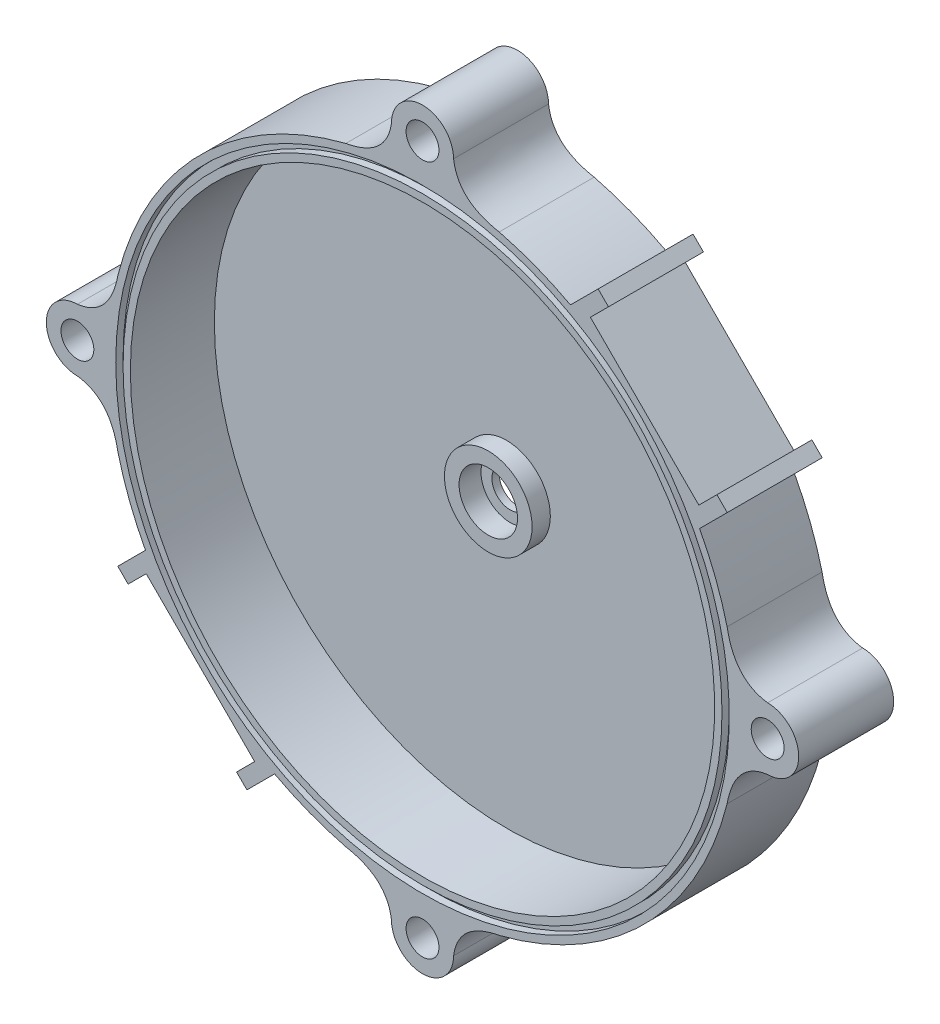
ISO-10303-21;
HEADER;
FILE_DESCRIPTION(('STEP AP214'),'2;1');
FILE_NAME('part.step','',(''),(''),'','','');
FILE_SCHEMA(('AUTOMOTIVE_DESIGN { 1 0 10303 214 1 1 1 1 }'));
ENDSEC;
DATA;
#1=APPLICATION_CONTEXT('core data for automotive mechanical design processes');
#2=APPLICATION_PROTOCOL_DEFINITION('international standard','automotive_design',2000,#1);
#3=PRODUCT_CONTEXT('',#1,'mechanical');
#4=PRODUCT('Part','Part','',(#3));
#5=PRODUCT_RELATED_PRODUCT_CATEGORY('part','',(#4));
#6=PRODUCT_DEFINITION_FORMATION('','',#4);
#7=PRODUCT_DEFINITION_CONTEXT('part definition',#1,'design');
#8=PRODUCT_DEFINITION('design','',#6,#7);
#9=PRODUCT_DEFINITION_SHAPE('','',#8);
#10=(LENGTH_UNIT() NAMED_UNIT(*) SI_UNIT(.MILLI.,.METRE.));
#11=(NAMED_UNIT(*) PLANE_ANGLE_UNIT() SI_UNIT($,.RADIAN.));
#12=(NAMED_UNIT(*) SI_UNIT($,.STERADIAN.) SOLID_ANGLE_UNIT());
#13=UNCERTAINTY_MEASURE_WITH_UNIT(LENGTH_MEASURE(1.E-05),#10,'distance_accuracy_value','');
#14=(GEOMETRIC_REPRESENTATION_CONTEXT(3) GLOBAL_UNCERTAINTY_ASSIGNED_CONTEXT((#13)) GLOBAL_UNIT_ASSIGNED_CONTEXT((#10,
#11,#12)) REPRESENTATION_CONTEXT('',''));
#15=CARTESIAN_POINT('',(0.,0.,0.));
#16=DIRECTION('',(0.,0.,1.));
#17=DIRECTION('',(1.,0.,0.));
#18=AXIS2_PLACEMENT_3D('',#15,#16,#17);
#19=CARTESIAN_POINT('',(0.,0.,1.));
#20=DIRECTION('',(0.,0.,-1.));
#21=DIRECTION('',(-1.,0.,0.));
#22=AXIS2_PLACEMENT_3D('',#19,#20,#21);
#23=CYLINDRICAL_SURFACE('',#22,2.5);
#24=CARTESIAN_POINT('',(0.,0.,1.));
#25=DIRECTION('',(0.,0.,1.));
#26=DIRECTION('',(1.,0.,0.));
#27=AXIS2_PLACEMENT_3D('',#24,#25,#26);
#28=CIRCLE('',#27,2.5);
#29=CARTESIAN_POINT('',(2.5,0.,1.));
#30=VERTEX_POINT('',#29);
#31=EDGE_CURVE('E12',#30,#30,#28,.T.);
#32=ORIENTED_EDGE('',*,*,#31,.T.);
#33=EDGE_LOOP('',(#32));
#34=FACE_BOUND('',#33,.T.);
#35=CARTESIAN_POINT('',(0.,0.,0.));
#36=DIRECTION('',(0.,0.,1.));
#37=DIRECTION('',(1.,0.,0.));
#38=AXIS2_PLACEMENT_3D('',#35,#36,#37);
#39=CIRCLE('',#38,2.5);
#40=CARTESIAN_POINT('',(2.5,0.,0.));
#41=VERTEX_POINT('',#40);
#42=EDGE_CURVE('E177',#41,#41,#39,.T.);
#43=ORIENTED_EDGE('',*,*,#42,.F.);
#44=EDGE_LOOP('',(#43));
#45=FACE_BOUND('',#44,.T.);
#46=ADVANCED_FACE('F174',(#34,#45),#23,.F.);
#47=CARTESIAN_POINT('',(0.,0.,1.));
#48=DIRECTION('',(0.,0.,1.));
#49=DIRECTION('',(1.,0.,0.));
#50=AXIS2_PLACEMENT_3D('',#47,#48,#49);
#51=PLANE('',#50);
#52=ORIENTED_EDGE('',*,*,#31,.F.);
#53=EDGE_LOOP('',(#52));
#54=FACE_BOUND('',#53,.T.);
#55=CARTESIAN_POINT('',(0.,0.,1.));
#56=DIRECTION('',(0.,0.,1.));
#57=DIRECTION('',(1.,0.,0.));
#58=AXIS2_PLACEMENT_3D('',#55,#56,#57);
#59=CIRCLE('',#58,4.);
#60=CARTESIAN_POINT('',(4.,0.,1.));
#61=VERTEX_POINT('',#60);
#62=EDGE_CURVE('E509',#61,#61,#59,.F.);
#63=ORIENTED_EDGE('',*,*,#62,.F.);
#64=EDGE_LOOP('',(#63));
#65=FACE_BOUND('',#64,.T.);
#66=ADVANCED_FACE('F519',(#54,#65),#51,.T.);
#67=CARTESIAN_POINT('',(0.,0.,0.));
#68=DIRECTION('',(0.,0.,1.));
#69=DIRECTION('',(1.,0.,0.));
#70=AXIS2_PLACEMENT_3D('',#67,#68,#69);
#71=PLANE('',#70);
#72=ORIENTED_EDGE('',*,*,#42,.T.);
#73=EDGE_LOOP('',(#72));
#74=FACE_BOUND('',#73,.T.);
#75=CARTESIAN_POINT('',(-4.24999999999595,-47.2499999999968,0.));
#76=CARTESIAN_POINT('',(-4.85447069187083,-42.7250993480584,0.));
#77=CARTESIAN_POINT('',(-10.4949547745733,-41.6995914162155,0.));
#78=B_SPLINE_CURVE_WITH_KNOTS('',2,(#75,#76,#77),.UNSPECIFIED.,.F.,.F.,(3,3),(0.,1.),.UNSPECIFIED.);
#79=CARTESIAN_POINT('',(-4.24999999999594,-47.2499999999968,0.));
#80=VERTEX_POINT('',#79);
#81=CARTESIAN_POINT('',(-10.4949547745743,-41.6995914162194,0.));
#82=VERTEX_POINT('',#81);
#83=EDGE_CURVE('E763',#80,#82,#78,.T.);
#84=ORIENTED_EDGE('',*,*,#83,.T.);
#85=CARTESIAN_POINT('',(0.,0.,0.));
#86=DIRECTION('',(0.,0.,1.));
#87=DIRECTION('',(1.,0.,0.));
#88=AXIS2_PLACEMENT_3D('',#85,#86,#87);
#89=CIRCLE('',#88,43.);
#90=CARTESIAN_POINT('',(-20.2536900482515,-37.9313595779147,0.));
#91=VERTEX_POINT('',#90);
#92=EDGE_CURVE('E290',#91,#82,#89,.T.);
#93=ORIENTED_EDGE('',*,*,#92,.F.);
#94=DIRECTION('',(0.707106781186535,0.70710678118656,0.));
#95=VECTOR('',#94,1.);
#96=CARTESIAN_POINT('',(8.83883476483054,-8.83883476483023,0.));
#97=LINE('',#96,#95);
#98=CARTESIAN_POINT('',(-24.0416305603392,-41.7193000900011,0.));
#99=VERTEX_POINT('',#98);
#100=EDGE_CURVE('E882',#99,#91,#97,.T.);
#101=ORIENTED_EDGE('',*,*,#100,.F.);
#102=DIRECTION('',(0.707106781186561,-0.707106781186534,0.));
#103=VECTOR('',#102,1.);
#104=CARTESIAN_POINT('',(-32.8804653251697,-32.880465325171,0.));
#105=LINE('',#104,#103);
#106=CARTESIAN_POINT('',(-25.4558441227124,-40.3050865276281,0.));
#107=VERTEX_POINT('',#106);
#108=EDGE_CURVE('E411',#107,#99,#105,.T.);
#109=ORIENTED_EDGE('',*,*,#108,.F.);
#110=DIRECTION('',(-0.707106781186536,-0.707106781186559,0.));
#111=VECTOR('',#110,1.);
#112=CARTESIAN_POINT('',(7.42462120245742,-7.42462120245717,0.));
#113=LINE('',#112,#111);
#114=CARTESIAN_POINT('',(-22.9809703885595,-37.8302127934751,0.));
#115=VERTEX_POINT('',#114);
#116=EDGE_CURVE('E878',#115,#107,#113,.T.);
#117=ORIENTED_EDGE('',*,*,#116,.F.);
#118=DIRECTION('',(-0.707106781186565,0.707106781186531,0.));
#119=VECTOR('',#118,1.);
#120=CARTESIAN_POINT('',(-30.4055915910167,-30.4055915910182,0.));
#121=LINE('',#120,#119);
#122=CARTESIAN_POINT('',(-37.8302127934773,-22.9809703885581,0.));
#123=VERTEX_POINT('',#122);
#124=EDGE_CURVE('E875',#115,#123,#121,.T.);
#125=ORIENTED_EDGE('',*,*,#124,.T.);
#126=DIRECTION('',(-0.707106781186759,-0.707106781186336,0.));
#127=VECTOR('',#126,1.);
#128=CARTESIAN_POINT('',(-7.42462120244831,7.42462120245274,0.));
#129=LINE('',#128,#127);
#130=CARTESIAN_POINT('',(-40.3050865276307,-25.4558441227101,0.));
#131=VERTEX_POINT('',#130);
#132=EDGE_CURVE('E872',#123,#131,#129,.T.);
#133=ORIENTED_EDGE('',*,*,#132,.T.);
#134=DIRECTION('',(-0.707106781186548,0.707106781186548,0.));
#135=VECTOR('',#134,1.);
#136=CARTESIAN_POINT('',(-32.8804653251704,-32.8804653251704,0.));
#137=LINE('',#136,#135);
#138=CARTESIAN_POINT('',(-41.7193000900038,-24.041630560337,0.));
#139=VERTEX_POINT('',#138);
#140=EDGE_CURVE('E869',#131,#139,#137,.T.);
#141=ORIENTED_EDGE('',*,*,#140,.T.);
#142=DIRECTION('',(0.70710678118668,0.707106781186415,0.));
#143=VECTOR('',#142,1.);
#144=CARTESIAN_POINT('',(-8.83883476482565,8.83883476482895,0.));
#145=LINE('',#144,#143);
#146=CARTESIAN_POINT('',(-37.9313595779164,-20.2536900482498,0.));
#147=VERTEX_POINT('',#146);
#148=EDGE_CURVE('E863',#139,#147,#145,.T.);
#149=ORIENTED_EDGE('',*,*,#148,.T.);
#150=CARTESIAN_POINT('',(-41.6995914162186,-10.4949547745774,0.));
#151=VERTEX_POINT('',#150);
#152=EDGE_CURVE('E862',#151,#147,#89,.T.);
#153=ORIENTED_EDGE('',*,*,#152,.F.);
#154=CARTESIAN_POINT('',(-47.25,-4.25000000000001,0.));
#155=CARTESIAN_POINT('',(-42.7250993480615,-4.85447069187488,0.));
#156=CARTESIAN_POINT('',(-41.6995914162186,-10.4949547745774,0.));
#157=B_SPLINE_CURVE_WITH_KNOTS('',2,(#154,#155,#156),.UNSPECIFIED.,.F.,.F.,(3,3),(0.,1.),.UNSPECIFIED.);
#158=CARTESIAN_POINT('',(-47.25,-4.25000000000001,0.));
#159=VERTEX_POINT('',#158);
#160=EDGE_CURVE('E857',#159,#151,#157,.T.);
#161=ORIENTED_EDGE('',*,*,#160,.F.);
#162=CARTESIAN_POINT('',(-47.25,0.,0.));
#163=DIRECTION('',(0.,0.,1.));
#164=DIRECTION('',(1.,0.,0.));
#165=AXIS2_PLACEMENT_3D('',#162,#163,#164);
#166=CIRCLE('',#165,4.25);
#167=CARTESIAN_POINT('',(-47.25,4.25,0.));
#168=VERTEX_POINT('',#167);
#169=EDGE_CURVE('E851',#168,#159,#166,.T.);
#170=ORIENTED_EDGE('',*,*,#169,.F.);
#171=CARTESIAN_POINT('',(-47.25,4.25,0.));
#172=CARTESIAN_POINT('',(-42.7250993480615,4.85447069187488,0.));
#173=CARTESIAN_POINT('',(-41.6995914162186,10.4949547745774,0.));
#174=B_SPLINE_CURVE_WITH_KNOTS('',2,(#171,#172,#173),.UNSPECIFIED.,.F.,.F.,(3,3),(0.,1.),.UNSPECIFIED.);
#175=CARTESIAN_POINT('',(-41.6995914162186,10.4949547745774,0.));
#176=VERTEX_POINT('',#175);
#177=EDGE_CURVE('E843',#168,#176,#174,.T.);
#178=ORIENTED_EDGE('',*,*,#177,.T.);
#179=CARTESIAN_POINT('',(-10.4949547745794,41.6995914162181,0.));
#180=VERTEX_POINT('',#179);
#181=EDGE_CURVE('E842',#180,#176,#89,.T.);
#182=ORIENTED_EDGE('',*,*,#181,.F.);
#183=CARTESIAN_POINT('',(-4.25000000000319,47.2500000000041,0.));
#184=CARTESIAN_POINT('',(-4.85447069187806,42.7250993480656,0.));
#185=CARTESIAN_POINT('',(-10.4949547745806,41.6995914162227,0.));
#186=B_SPLINE_CURVE_WITH_KNOTS('',2,(#183,#184,#185),.UNSPECIFIED.,.F.,.F.,(3,3),(0.,1.),.UNSPECIFIED.);
#187=CARTESIAN_POINT('',(-4.25000000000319,47.2500000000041,0.));
#188=VERTEX_POINT('',#187);
#189=EDGE_CURVE('E837',#188,#180,#186,.T.);
#190=ORIENTED_EDGE('',*,*,#189,.F.);
#191=CARTESIAN_POINT('',(-3.18177399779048E-12,47.2500000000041,0.));
#192=DIRECTION('',(0.,0.,1.));
#193=DIRECTION('',(1.,0.,0.));
#194=AXIS2_PLACEMENT_3D('',#191,#192,#193);
#195=CIRCLE('',#194,4.25);
#196=CARTESIAN_POINT('',(4.24999999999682,47.2500000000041,0.));
#197=VERTEX_POINT('',#196);
#198=EDGE_CURVE('E831',#197,#188,#195,.T.);
#199=ORIENTED_EDGE('',*,*,#198,.F.);
#200=CARTESIAN_POINT('',(4.24999999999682,47.2500000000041,0.));
#201=CARTESIAN_POINT('',(4.8544706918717,42.7250993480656,0.));
#202=CARTESIAN_POINT('',(10.4949547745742,41.6995914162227,0.));
#203=B_SPLINE_CURVE_WITH_KNOTS('',2,(#200,#201,#202),.UNSPECIFIED.,.F.,.F.,(3,3),(0.,1.),.UNSPECIFIED.);
#204=CARTESIAN_POINT('',(10.4949547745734,41.6995914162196,0.));
#205=VERTEX_POINT('',#204);
#206=EDGE_CURVE('E826',#197,#205,#203,.T.);
#207=ORIENTED_EDGE('',*,*,#206,.T.);
#208=CARTESIAN_POINT('',(20.2536900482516,37.9313595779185,0.));
#209=VERTEX_POINT('',#208);
#210=EDGE_CURVE('E825',#209,#205,#89,.T.);
#211=ORIENTED_EDGE('',*,*,#210,.F.);
#212=DIRECTION('',(-0.70710678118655,-0.707106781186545,0.));
#213=VECTOR('',#212,1.);
#214=CARTESIAN_POINT('',(-8.83883476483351,8.83883476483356,0.));
#215=LINE('',#214,#213);
#216=CARTESIAN_POINT('',(24.041630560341,41.7193000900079,0.));
#217=VERTEX_POINT('',#216);
#218=EDGE_CURVE('E822',#217,#209,#215,.T.);
#219=ORIENTED_EDGE('',*,*,#218,.F.);
#220=DIRECTION('',(-0.707106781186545,0.70710678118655,0.));
#221=VECTOR('',#220,1.);
#222=CARTESIAN_POINT('',(32.8804653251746,32.8804653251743,0.));
#223=LINE('',#222,#221);
#224=CARTESIAN_POINT('',(25.4558441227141,40.3050865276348,0.));
#225=VERTEX_POINT('',#224);
#226=EDGE_CURVE('E819',#225,#217,#223,.T.);
#227=ORIENTED_EDGE('',*,*,#226,.F.);
#228=DIRECTION('',(0.707106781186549,0.707106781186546,0.));
#229=VECTOR('',#228,1.);
#230=CARTESIAN_POINT('',(-7.42462120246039,7.42462120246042,0.));
#231=LINE('',#230,#229);
#232=CARTESIAN_POINT('',(22.9809703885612,37.8302127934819,0.));
#233=VERTEX_POINT('',#232);
#234=EDGE_CURVE('E816',#233,#225,#231,.T.);
#235=ORIENTED_EDGE('',*,*,#234,.F.);
#236=DIRECTION('',(-0.707106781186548,0.707106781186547,0.));
#237=VECTOR('',#236,1.);
#238=CARTESIAN_POINT('',(30.4055915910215,30.4055915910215,0.));
#239=LINE('',#238,#237);
#240=CARTESIAN_POINT('',(37.8302127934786,22.9809703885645,0.));
#241=VERTEX_POINT('',#240);
#242=EDGE_CURVE('E813',#241,#233,#239,.T.);
#243=ORIENTED_EDGE('',*,*,#242,.F.);
#244=DIRECTION('',(0.707106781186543,0.707106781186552,0.));
#245=VECTOR('',#244,1.);
#246=CARTESIAN_POINT('',(7.42462120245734,-7.42462120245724,0.));
#247=LINE('',#246,#245);
#248=CARTESIAN_POINT('',(40.3050865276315,25.4558441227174,0.));
#249=VERTEX_POINT('',#248);
#250=EDGE_CURVE('E810',#241,#249,#247,.T.);
#251=ORIENTED_EDGE('',*,*,#250,.T.);
#252=DIRECTION('',(0.707106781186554,-0.707106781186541,0.));
#253=VECTOR('',#252,1.);
#254=CARTESIAN_POINT('',(32.8804653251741,32.8804653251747,0.));
#255=LINE('',#254,#253);
#256=CARTESIAN_POINT('',(41.7193000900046,24.0416305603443,0.));
#257=VERTEX_POINT('',#256);
#258=EDGE_CURVE('E807',#249,#257,#255,.T.);
#259=ORIENTED_EDGE('',*,*,#258,.T.);
#260=DIRECTION('',(-0.707106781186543,-0.707106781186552,0.));
#261=VECTOR('',#260,1.);
#262=CARTESIAN_POINT('',(8.83883476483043,-8.83883476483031,0.));
#263=LINE('',#262,#261);
#264=CARTESIAN_POINT('',(37.9313595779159,20.2536900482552,0.));
#265=VERTEX_POINT('',#264);
#266=EDGE_CURVE('E801',#257,#265,#263,.T.);
#267=ORIENTED_EDGE('',*,*,#266,.T.);
#268=CARTESIAN_POINT('',(41.699591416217,10.494954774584,0.));
#269=VERTEX_POINT('',#268);
#270=EDGE_CURVE('E785',#269,#265,#89,.T.);
#271=ORIENTED_EDGE('',*,*,#270,.F.);
#272=CARTESIAN_POINT('',(47.2500000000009,4.25000000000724,0.));
#273=CARTESIAN_POINT('',(42.7250993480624,4.85447069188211,0.));
#274=CARTESIAN_POINT('',(41.6995914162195,10.4949547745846,0.));
#275=B_SPLINE_CURVE_WITH_KNOTS('',2,(#272,#273,#274),.UNSPECIFIED.,.F.,.F.,(3,3),(0.,1.),.UNSPECIFIED.);
#276=CARTESIAN_POINT('',(47.2500000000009,4.25000000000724,0.));
#277=VERTEX_POINT('',#276);
#278=EDGE_CURVE('E796',#277,#269,#275,.T.);
#279=ORIENTED_EDGE('',*,*,#278,.F.);
#280=CARTESIAN_POINT('',(47.2500000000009,7.23784862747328E-12,0.));
#281=DIRECTION('',(0.,0.,1.));
#282=DIRECTION('',(1.,0.,0.));
#283=AXIS2_PLACEMENT_3D('',#280,#281,#282);
#284=CIRCLE('',#283,4.25);
#285=CARTESIAN_POINT('',(47.2500000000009,-4.24999999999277,0.));
#286=VERTEX_POINT('',#285);
#287=EDGE_CURVE('E790',#286,#277,#284,.T.);
#288=ORIENTED_EDGE('',*,*,#287,.F.);
#289=CARTESIAN_POINT('',(47.2500000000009,-4.24999999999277,0.));
#290=CARTESIAN_POINT('',(42.7250993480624,-4.85447069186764,0.));
#291=CARTESIAN_POINT('',(41.6995914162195,-10.4949547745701,0.));
#292=B_SPLINE_CURVE_WITH_KNOTS('',2,(#289,#290,#291),.UNSPECIFIED.,.F.,.F.,(3,3),(0.,1.),.UNSPECIFIED.);
#293=CARTESIAN_POINT('',(41.6995914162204,-10.4949547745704,0.));
#294=VERTEX_POINT('',#293);
#295=EDGE_CURVE('E784',#286,#294,#292,.T.);
#296=ORIENTED_EDGE('',*,*,#295,.T.);
#297=CARTESIAN_POINT('',(10.4949547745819,-41.6995914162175,0.));
#298=VERTEX_POINT('',#297);
#299=EDGE_CURVE('E778',#298,#294,#89,.T.);
#300=ORIENTED_EDGE('',*,*,#299,.F.);
#301=CARTESIAN_POINT('',(4.25000000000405,-47.2499999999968,0.));
#302=CARTESIAN_POINT('',(4.85447069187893,-42.7250993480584,0.));
#303=CARTESIAN_POINT('',(10.4949547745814,-41.6995914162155,0.));
#304=B_SPLINE_CURVE_WITH_KNOTS('',2,(#301,#302,#303),.UNSPECIFIED.,.F.,.F.,(3,3),(0.,1.),.UNSPECIFIED.);
#305=CARTESIAN_POINT('',(4.25000000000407,-47.2499999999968,0.));
#306=VERTEX_POINT('',#305);
#307=EDGE_CURVE('E773',#306,#298,#304,.T.);
#308=ORIENTED_EDGE('',*,*,#307,.F.);
#309=CARTESIAN_POINT('',(4.06186108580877E-12,-47.2499999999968,0.));
#310=DIRECTION('',(0.,0.,1.));
#311=DIRECTION('',(1.,0.,0.));
#312=AXIS2_PLACEMENT_3D('',#309,#310,#311);
#313=CIRCLE('',#312,4.25);
#314=EDGE_CURVE('E767',#80,#306,#313,.T.);
#315=ORIENTED_EDGE('',*,*,#314,.F.);
#316=EDGE_LOOP('',(#84,#93,#101,#109,#117,#125,#133,#141,#149,#153,#161,#170,#178,#182,#190,
#199,#207,#211,#219,#227,#235,#243,#251,#259,#267,#271,#279,#288,#296,#300,#308,#315));
#317=FACE_BOUND('',#316,.T.);
#318=CARTESIAN_POINT('',(-47.25,0.,0.));
#319=DIRECTION('',(0.,0.,1.));
#320=DIRECTION('',(1.,0.,0.));
#321=AXIS2_PLACEMENT_3D('',#318,#319,#320);
#322=CIRCLE('',#321,2.25);
#323=CARTESIAN_POINT('',(-49.5,0.,0.));
#324=VERTEX_POINT('',#323);
#325=EDGE_CURVE('E884',#324,#324,#322,.T.);
#326=ORIENTED_EDGE('',*,*,#325,.T.);
#327=EDGE_LOOP('',(#326));
#328=FACE_BOUND('',#327,.T.);
#329=CARTESIAN_POINT('',(-3.18177399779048E-12,47.2500000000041,0.));
#330=DIRECTION('',(0.,0.,1.));
#331=DIRECTION('',(1.,0.,0.));
#332=AXIS2_PLACEMENT_3D('',#329,#330,#331);
#333=CIRCLE('',#332,2.25000000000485);
#334=CARTESIAN_POINT('',(-2.25000000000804,47.2500000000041,0.));
#335=VERTEX_POINT('',#334);
#336=EDGE_CURVE('E887',#335,#335,#333,.T.);
#337=ORIENTED_EDGE('',*,*,#336,.T.);
#338=EDGE_LOOP('',(#337));
#339=FACE_BOUND('',#338,.T.);
#340=CARTESIAN_POINT('',(47.2500000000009,7.23784862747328E-12,0.));
#341=DIRECTION('',(0.,0.,1.));
#342=DIRECTION('',(1.,0.,0.));
#343=AXIS2_PLACEMENT_3D('',#340,#341,#342);
#344=CIRCLE('',#343,2.25000000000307);
#345=CARTESIAN_POINT('',(44.9999999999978,7.23784862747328E-12,0.));
#346=VERTEX_POINT('',#345);
#347=EDGE_CURVE('E890',#346,#346,#344,.T.);
#348=ORIENTED_EDGE('',*,*,#347,.T.);
#349=EDGE_LOOP('',(#348));
#350=FACE_BOUND('',#349,.T.);
#351=CARTESIAN_POINT('',(4.06186108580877E-12,-47.2499999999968,0.));
#352=DIRECTION('',(0.,0.,1.));
#353=DIRECTION('',(1.,0.,0.));
#354=AXIS2_PLACEMENT_3D('',#351,#352,#353);
#355=CIRCLE('',#354,2.24999999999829);
#356=CARTESIAN_POINT('',(-2.24999999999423,-47.2499999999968,0.));
#357=VERTEX_POINT('',#356);
#358=EDGE_CURVE('E893',#357,#357,#355,.T.);
#359=ORIENTED_EDGE('',*,*,#358,.T.);
#360=EDGE_LOOP('',(#359));
#361=FACE_BOUND('',#360,.T.);
#362=ADVANCED_FACE('F516',(#74,#317,#328,#339,#350,#361),#71,.F.);
#363=CARTESIAN_POINT('',(0.,0.,4.));
#364=DIRECTION('',(0.,0.,-1.));
#365=DIRECTION('',(-1.,0.,0.));
#366=AXIS2_PLACEMENT_3D('',#363,#364,#365);
#367=CYLINDRICAL_SURFACE('',#366,4.);
#368=ORIENTED_EDGE('',*,*,#62,.T.);
#369=EDGE_LOOP('',(#368));
#370=FACE_BOUND('',#369,.T.);
#371=CARTESIAN_POINT('',(0.,0.,4.));
#372=DIRECTION('',(0.,0.,1.));
#373=DIRECTION('',(1.,0.,0.));
#374=AXIS2_PLACEMENT_3D('',#371,#372,#373);
#375=CIRCLE('',#374,4.);
#376=CARTESIAN_POINT('',(4.,0.,4.));
#377=VERTEX_POINT('',#376);
#378=EDGE_CURVE('E503',#377,#377,#375,.T.);
#379=ORIENTED_EDGE('',*,*,#378,.T.);
#380=EDGE_LOOP('',(#379));
#381=FACE_BOUND('',#380,.T.);
#382=ADVANCED_FACE('F531',(#370,#381),#367,.F.);
#383=CARTESIAN_POINT('',(0.,0.,4.));
#384=DIRECTION('',(0.,0.,-1.));
#385=DIRECTION('',(-1.,0.,0.));
#386=AXIS2_PLACEMENT_3D('',#383,#384,#385);
#387=CYLINDRICAL_SURFACE('',#386,6.);
#388=CARTESIAN_POINT('',(0.,0.,1.5));
#389=DIRECTION('',(0.,0.,1.));
#390=DIRECTION('',(1.,0.,0.));
#391=AXIS2_PLACEMENT_3D('',#388,#389,#390);
#392=CIRCLE('',#391,6.);
#393=CARTESIAN_POINT('',(6.,0.,1.5));
#394=VERTEX_POINT('',#393);
#395=EDGE_CURVE('E500',#394,#394,#392,.T.);
#396=ORIENTED_EDGE('',*,*,#395,.T.);
#397=EDGE_LOOP('',(#396));
#398=FACE_BOUND('',#397,.T.);
#399=CARTESIAN_POINT('',(0.,0.,4.));
#400=DIRECTION('',(0.,0.,1.));
#401=DIRECTION('',(1.,0.,0.));
#402=AXIS2_PLACEMENT_3D('',#399,#400,#401);
#403=CIRCLE('',#402,6.);
#404=CARTESIAN_POINT('',(6.,0.,4.));
#405=VERTEX_POINT('',#404);
#406=EDGE_CURVE('E506',#405,#405,#403,.T.);
#407=ORIENTED_EDGE('',*,*,#406,.F.);
#408=EDGE_LOOP('',(#407));
#409=FACE_BOUND('',#408,.T.);
#410=ADVANCED_FACE('F535',(#398,#409),#387,.T.);
#411=CARTESIAN_POINT('',(0.,0.,4.));
#412=DIRECTION('',(0.,0.,1.));
#413=DIRECTION('',(1.,0.,0.));
#414=AXIS2_PLACEMENT_3D('',#411,#412,#413);
#415=PLANE('',#414);
#416=ORIENTED_EDGE('',*,*,#378,.F.);
#417=EDGE_LOOP('',(#416));
#418=FACE_BOUND('',#417,.T.);
#419=ORIENTED_EDGE('',*,*,#406,.T.);
#420=EDGE_LOOP('',(#419));
#421=FACE_BOUND('',#420,.T.);
#422=ADVANCED_FACE('F538',(#418,#421),#415,.T.);
#423=CARTESIAN_POINT('',(0.,0.,1.5));
#424=DIRECTION('',(0.,0.,1.));
#425=DIRECTION('',(1.,0.,0.));
#426=AXIS2_PLACEMENT_3D('',#423,#424,#425);
#427=PLANE('',#426);
#428=ORIENTED_EDGE('',*,*,#395,.F.);
#429=EDGE_LOOP('',(#428));
#430=FACE_BOUND('',#429,.T.);
#431=CARTESIAN_POINT('',(0.,0.,1.5));
#432=DIRECTION('',(0.,0.,1.));
#433=DIRECTION('',(1.,0.,0.));
#434=AXIS2_PLACEMENT_3D('',#431,#432,#433);
#435=CIRCLE('',#434,40.);
#436=CARTESIAN_POINT('',(-40.,0.,1.5));
#437=VERTEX_POINT('',#436);
#438=EDGE_CURVE('E497',#437,#437,#435,.F.);
#439=ORIENTED_EDGE('',*,*,#438,.F.);
#440=EDGE_LOOP('',(#439));
#441=FACE_BOUND('',#440,.T.);
#442=ADVANCED_FACE('F542',(#430,#441),#427,.T.);
#443=CARTESIAN_POINT('',(0.,0.,13.));
#444=DIRECTION('',(0.,0.,-1.));
#445=DIRECTION('',(-1.,0.,0.));
#446=AXIS2_PLACEMENT_3D('',#443,#444,#445);
#447=CYLINDRICAL_SURFACE('',#446,40.);
#448=CARTESIAN_POINT('',(0.,0.,13.));
#449=DIRECTION('',(0.,0.,1.));
#450=DIRECTION('',(1.,0.,0.));
#451=AXIS2_PLACEMENT_3D('',#448,#449,#450);
#452=CIRCLE('',#451,40.);
#453=CARTESIAN_POINT('',(-40.,0.,13.));
#454=VERTEX_POINT('',#453);
#455=EDGE_CURVE('E491',#454,#454,#452,.T.);
#456=CARTESIAN_POINT('',(-40.,0.,1.5));
#457=CARTESIAN_POINT('',(-40.,0.,1.61979166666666));
#458=CARTESIAN_POINT('',(-40.,0.,1.73958333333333));
#459=CARTESIAN_POINT('',(-40.,0.,1.97916666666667));
#460=CARTESIAN_POINT('',(-40.,0.,2.09895833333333));
#461=CARTESIAN_POINT('',(-40.,0.,2.33854166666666));
#462=CARTESIAN_POINT('',(-40.,0.,2.45833333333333));
#463=CARTESIAN_POINT('',(-40.,0.,2.69791666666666));
#464=CARTESIAN_POINT('',(-40.,0.,2.81770833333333));
#465=CARTESIAN_POINT('',(-40.,0.,3.05729166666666));
#466=CARTESIAN_POINT('',(-40.,0.,3.17708333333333));
#467=CARTESIAN_POINT('',(-40.,0.,3.41666666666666));
#468=CARTESIAN_POINT('',(-40.,0.,3.53645833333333));
#469=CARTESIAN_POINT('',(-40.,0.,3.77604166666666));
#470=CARTESIAN_POINT('',(-40.,0.,3.89583333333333));
#471=CARTESIAN_POINT('',(-40.,0.,4.13541666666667));
#472=CARTESIAN_POINT('',(-40.,0.,4.25520833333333));
#473=CARTESIAN_POINT('',(-40.,0.,4.49479166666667));
#474=CARTESIAN_POINT('',(-40.,0.,4.61458333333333));
#475=CARTESIAN_POINT('',(-40.,0.,4.85416666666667));
#476=CARTESIAN_POINT('',(-40.,0.,4.97395833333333));
#477=CARTESIAN_POINT('',(-40.,0.,5.21354166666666));
#478=CARTESIAN_POINT('',(-40.,0.,5.33333333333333));
#479=CARTESIAN_POINT('',(-40.,0.,5.57291666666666));
#480=CARTESIAN_POINT('',(-40.,0.,5.69270833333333));
#481=CARTESIAN_POINT('',(-40.,0.,5.93229166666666));
#482=CARTESIAN_POINT('',(-40.,0.,6.05208333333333));
#483=CARTESIAN_POINT('',(-40.,0.,6.29166666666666));
#484=CARTESIAN_POINT('',(-40.,0.,6.41145833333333));
#485=CARTESIAN_POINT('',(-40.,0.,6.65104166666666));
#486=CARTESIAN_POINT('',(-40.,0.,6.77083333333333));
#487=CARTESIAN_POINT('',(-40.,0.,7.01041666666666));
#488=CARTESIAN_POINT('',(-40.,0.,7.13020833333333));
#489=CARTESIAN_POINT('',(-40.,0.,7.36979166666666));
#490=CARTESIAN_POINT('',(-40.,0.,7.48958333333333));
#491=CARTESIAN_POINT('',(-40.,0.,7.72916666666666));
#492=CARTESIAN_POINT('',(-40.,0.,7.84895833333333));
#493=CARTESIAN_POINT('',(-40.,0.,8.08854166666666));
#494=CARTESIAN_POINT('',(-40.,0.,8.20833333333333));
#495=CARTESIAN_POINT('',(-40.,0.,8.44791666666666));
#496=CARTESIAN_POINT('',(-40.,0.,8.56770833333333));
#497=CARTESIAN_POINT('',(-40.,0.,8.80729166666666));
#498=CARTESIAN_POINT('',(-40.,0.,8.92708333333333));
#499=CARTESIAN_POINT('',(-40.,0.,9.16666666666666));
#500=CARTESIAN_POINT('',(-40.,0.,9.28645833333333));
#501=CARTESIAN_POINT('',(-40.,0.,9.52604166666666));
#502=CARTESIAN_POINT('',(-40.,0.,9.64583333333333));
#503=CARTESIAN_POINT('',(-40.,0.,9.88541666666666));
#504=CARTESIAN_POINT('',(-40.,0.,10.0052083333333));
#505=CARTESIAN_POINT('',(-40.,0.,10.2447916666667));
#506=CARTESIAN_POINT('',(-40.,0.,10.3645833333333));
#507=CARTESIAN_POINT('',(-40.,0.,10.6041666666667));
#508=CARTESIAN_POINT('',(-40.,0.,10.7239583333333));
#509=CARTESIAN_POINT('',(-40.,0.,10.9635416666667));
#510=CARTESIAN_POINT('',(-40.,0.,11.0833333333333));
#511=CARTESIAN_POINT('',(-40.,0.,11.3229166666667));
#512=CARTESIAN_POINT('',(-40.,0.,11.4427083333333));
#513=CARTESIAN_POINT('',(-40.,0.,11.6822916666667));
#514=CARTESIAN_POINT('',(-40.,0.,11.8020833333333));
#515=CARTESIAN_POINT('',(-40.,0.,12.0416666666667));
#516=CARTESIAN_POINT('',(-40.,0.,12.1614583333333));
#517=CARTESIAN_POINT('',(-40.,0.,12.4010416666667));
#518=CARTESIAN_POINT('',(-40.,0.,12.5208333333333));
#519=CARTESIAN_POINT('',(-40.,0.,12.7604166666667));
#520=CARTESIAN_POINT('',(-40.,0.,12.8802083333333));
#521=CARTESIAN_POINT('',(-40.,0.,13.));
#522=B_SPLINE_CURVE_WITH_KNOTS('',3,(#456,#457,#458,#459,#460,#461,#462,#463,#464,#465,#466,
#467,#468,#469,#470,#471,#472,#473,#474,#475,#476,#477,#478,#479,#480,#481,#482,#483,#484,#485,
#486,#487,#488,#489,#490,#491,#492,#493,#494,#495,#496,#497,#498,#499,#500,#501,#502,#503,#504,
#505,#506,#507,#508,#509,#510,#511,#512,#513,#514,#515,#516,#517,#518,#519,#520,#521),
.UNSPECIFIED.,.F.,.F.,(4,2,2,2,2,2,2,2,2,2,2,2,2,2,2,2,2,2,2,2,2,2,2,2,2,2,2,2,2,2,2,2,4),(0.,
0.359375,0.718750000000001,1.078125,1.4375,1.796875,2.15625,2.515625,2.875,3.234375,3.59375,
3.953125,4.3125,4.671875,5.03125,5.390625,5.75,6.109375,6.46875,6.828125,7.1875,7.546875,
7.90625,8.265625,8.625,8.984375,9.34375,9.703125,10.0625,10.421875,10.78125,11.140625,11.5),.UNSPECIFIED.);
#523=EDGE_CURVE('BSEAM546',#437,#454,#522,.T.);
#524=ORIENTED_EDGE('',*,*,#438,.T.);
#525=ORIENTED_EDGE('',*,*,#455,.T.);
#526=ORIENTED_EDGE('',*,*,#523,.T.);
#527=ORIENTED_EDGE('',*,*,#523,.F.);
#528=EDGE_LOOP('',(#524,#526,#525,#527));
#529=FACE_BOUND('',#528,.T.);
#530=ADVANCED_FACE('F546',(#529),#447,.F.);
#531=CARTESIAN_POINT('',(0.,0.,13.));
#532=DIRECTION('',(0.,0.,-1.));
#533=DIRECTION('',(-1.,0.,0.));
#534=AXIS2_PLACEMENT_3D('',#531,#532,#533);
#535=CYLINDRICAL_SURFACE('',#534,41.);
#536=CARTESIAN_POINT('',(0.,0.,12.));
#537=DIRECTION('',(0.,0.,1.));
#538=DIRECTION('',(1.,0.,0.));
#539=AXIS2_PLACEMENT_3D('',#536,#537,#538);
#540=CIRCLE('',#539,41.);
#541=CARTESIAN_POINT('',(-41.,0.,12.));
#542=VERTEX_POINT('',#541);
#543=EDGE_CURVE('E488',#542,#542,#540,.T.);
#544=CARTESIAN_POINT('',(0.,0.,13.));
#545=DIRECTION('',(0.,0.,1.));
#546=DIRECTION('',(1.,0.,0.));
#547=AXIS2_PLACEMENT_3D('',#544,#545,#546);
#548=CIRCLE('',#547,41.);
#549=CARTESIAN_POINT('',(-41.,0.,13.));
#550=VERTEX_POINT('',#549);
#551=EDGE_CURVE('E494',#550,#550,#548,.T.);
#552=CARTESIAN_POINT('',(-41.,0.,12.));
#553=CARTESIAN_POINT('',(-41.,0.,12.0104166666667));
#554=CARTESIAN_POINT('',(-41.,0.,12.0208333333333));
#555=CARTESIAN_POINT('',(-41.,0.,12.0416666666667));
#556=CARTESIAN_POINT('',(-41.,0.,12.0520833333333));
#557=CARTESIAN_POINT('',(-41.,0.,12.0729166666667));
#558=CARTESIAN_POINT('',(-41.,0.,12.0833333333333));
#559=CARTESIAN_POINT('',(-41.,0.,12.1041666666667));
#560=CARTESIAN_POINT('',(-41.,0.,12.1145833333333));
#561=CARTESIAN_POINT('',(-41.,0.,12.1354166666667));
#562=CARTESIAN_POINT('',(-41.,0.,12.1458333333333));
#563=CARTESIAN_POINT('',(-41.,0.,12.1666666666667));
#564=CARTESIAN_POINT('',(-41.,0.,12.1770833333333));
#565=CARTESIAN_POINT('',(-41.,0.,12.1979166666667));
#566=CARTESIAN_POINT('',(-41.,0.,12.2083333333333));
#567=CARTESIAN_POINT('',(-41.,0.,12.2291666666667));
#568=CARTESIAN_POINT('',(-41.,0.,12.2395833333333));
#569=CARTESIAN_POINT('',(-41.,0.,12.2604166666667));
#570=CARTESIAN_POINT('',(-41.,0.,12.2708333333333));
#571=CARTESIAN_POINT('',(-41.,0.,12.2916666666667));
#572=CARTESIAN_POINT('',(-41.,0.,12.3020833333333));
#573=CARTESIAN_POINT('',(-41.,0.,12.3229166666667));
#574=CARTESIAN_POINT('',(-41.,0.,12.3333333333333));
#575=CARTESIAN_POINT('',(-41.,0.,12.3541666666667));
#576=CARTESIAN_POINT('',(-41.,0.,12.3645833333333));
#577=CARTESIAN_POINT('',(-41.,0.,12.3854166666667));
#578=CARTESIAN_POINT('',(-41.,0.,12.3958333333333));
#579=CARTESIAN_POINT('',(-41.,0.,12.4166666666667));
#580=CARTESIAN_POINT('',(-41.,0.,12.4270833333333));
#581=CARTESIAN_POINT('',(-41.,0.,12.4479166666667));
#582=CARTESIAN_POINT('',(-41.,0.,12.4583333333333));
#583=CARTESIAN_POINT('',(-41.,0.,12.4791666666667));
#584=CARTESIAN_POINT('',(-41.,0.,12.4895833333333));
#585=CARTESIAN_POINT('',(-41.,0.,12.5104166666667));
#586=CARTESIAN_POINT('',(-41.,0.,12.5208333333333));
#587=CARTESIAN_POINT('',(-41.,0.,12.5416666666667));
#588=CARTESIAN_POINT('',(-41.,0.,12.5520833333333));
#589=CARTESIAN_POINT('',(-41.,0.,12.5729166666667));
#590=CARTESIAN_POINT('',(-41.,0.,12.5833333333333));
#591=CARTESIAN_POINT('',(-41.,0.,12.6041666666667));
#592=CARTESIAN_POINT('',(-41.,0.,12.6145833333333));
#593=CARTESIAN_POINT('',(-41.,0.,12.6354166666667));
#594=CARTESIAN_POINT('',(-41.,0.,12.6458333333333));
#595=CARTESIAN_POINT('',(-41.,0.,12.6666666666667));
#596=CARTESIAN_POINT('',(-41.,0.,12.6770833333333));
#597=CARTESIAN_POINT('',(-41.,0.,12.6979166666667));
#598=CARTESIAN_POINT('',(-41.,0.,12.7083333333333));
#599=CARTESIAN_POINT('',(-41.,0.,12.7291666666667));
#600=CARTESIAN_POINT('',(-41.,0.,12.7395833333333));
#601=CARTESIAN_POINT('',(-41.,0.,12.7604166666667));
#602=CARTESIAN_POINT('',(-41.,0.,12.7708333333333));
#603=CARTESIAN_POINT('',(-41.,0.,12.7916666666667));
#604=CARTESIAN_POINT('',(-41.,0.,12.8020833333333));
#605=CARTESIAN_POINT('',(-41.,0.,12.8229166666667));
#606=CARTESIAN_POINT('',(-41.,0.,12.8333333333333));
#607=CARTESIAN_POINT('',(-41.,0.,12.8541666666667));
#608=CARTESIAN_POINT('',(-41.,0.,12.8645833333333));
#609=CARTESIAN_POINT('',(-41.,0.,12.8854166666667));
#610=CARTESIAN_POINT('',(-41.,0.,12.8958333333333));
#611=CARTESIAN_POINT('',(-41.,0.,12.9166666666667));
#612=CARTESIAN_POINT('',(-41.,0.,12.9270833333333));
#613=CARTESIAN_POINT('',(-41.,0.,12.9479166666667));
#614=CARTESIAN_POINT('',(-41.,0.,12.9583333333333));
#615=CARTESIAN_POINT('',(-41.,0.,12.9791666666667));
#616=CARTESIAN_POINT('',(-41.,0.,12.9895833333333));
#617=CARTESIAN_POINT('',(-41.,0.,13.));
#618=B_SPLINE_CURVE_WITH_KNOTS('',3,(#552,#553,#554,#555,#556,#557,#558,#559,#560,#561,#562,
#563,#564,#565,#566,#567,#568,#569,#570,#571,#572,#573,#574,#575,#576,#577,#578,#579,#580,#581,
#582,#583,#584,#585,#586,#587,#588,#589,#590,#591,#592,#593,#594,#595,#596,#597,#598,#599,#600,
#601,#602,#603,#604,#605,#606,#607,#608,#609,#610,#611,#612,#613,#614,#615,#616,#617),
.UNSPECIFIED.,.F.,.F.,(4,2,2,2,2,2,2,2,2,2,2,2,2,2,2,2,2,2,2,2,2,2,2,2,2,2,2,2,2,2,2,2,4),(0.,
0.03125,0.0625000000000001,0.0937500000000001,0.125,0.15625,0.1875,0.21875,0.25,0.28125,0.3125,
0.34375,0.375,0.40625,0.4375,0.46875,0.5,0.53125,0.5625,0.593750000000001,0.625000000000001,
0.656250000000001,0.687500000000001,0.718750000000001,0.750000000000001,0.781250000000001,
0.812500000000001,0.843750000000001,0.875000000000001,0.906250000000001,0.937500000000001,
0.968750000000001,1.),.UNSPECIFIED.);
#619=EDGE_CURVE('BSEAM550',#542,#550,#618,.T.);
#620=ORIENTED_EDGE('',*,*,#543,.T.);
#621=ORIENTED_EDGE('',*,*,#551,.F.);
#622=ORIENTED_EDGE('',*,*,#619,.T.);
#623=ORIENTED_EDGE('',*,*,#619,.F.);
#624=EDGE_LOOP('',(#620,#622,#621,#623));
#625=FACE_BOUND('',#624,.T.);
#626=ADVANCED_FACE('F550',(#625),#535,.T.);
#627=CARTESIAN_POINT('',(0.,0.,13.));
#628=DIRECTION('',(0.,0.,1.));
#629=DIRECTION('',(1.,0.,0.));
#630=AXIS2_PLACEMENT_3D('',#627,#628,#629);
#631=PLANE('',#630);
#632=ORIENTED_EDGE('',*,*,#455,.F.);
#633=EDGE_LOOP('',(#632));
#634=FACE_BOUND('',#633,.T.);
#635=ORIENTED_EDGE('',*,*,#551,.T.);
#636=EDGE_LOOP('',(#635));
#637=FACE_BOUND('',#636,.T.);
#638=ADVANCED_FACE('F554',(#634,#637),#631,.T.);
#639=CARTESIAN_POINT('',(0.,0.,12.));
#640=DIRECTION('',(0.,0.,1.));
#641=DIRECTION('',(1.,0.,0.));
#642=AXIS2_PLACEMENT_3D('',#639,#640,#641);
#643=PLANE('',#642);
#644=ORIENTED_EDGE('',*,*,#543,.F.);
#645=EDGE_LOOP('',(#644));
#646=FACE_BOUND('',#645,.T.);
#647=CARTESIAN_POINT('',(0.,0.,12.));
#648=DIRECTION('',(0.,0.,1.));
#649=DIRECTION('',(1.,0.,0.));
#650=AXIS2_PLACEMENT_3D('',#647,#648,#649);
#651=CIRCLE('',#650,42.);
#652=CARTESIAN_POINT('',(-42.,0.,12.));
#653=VERTEX_POINT('',#652);
#654=EDGE_CURVE('E485',#653,#653,#651,.F.);
#655=ORIENTED_EDGE('',*,*,#654,.F.);
#656=EDGE_LOOP('',(#655));
#657=FACE_BOUND('',#656,.T.);
#658=ADVANCED_FACE('F558',(#646,#657),#643,.T.);
#659=CARTESIAN_POINT('',(-4.24999999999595,-47.2499999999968,13.));
#660=CARTESIAN_POINT('',(-4.85447069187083,-42.7250993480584,13.));
#661=CARTESIAN_POINT('',(-10.4949547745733,-41.6995914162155,13.));
#662=B_SPLINE_CURVE_WITH_KNOTS('',2,(#659,#660,#661),.UNSPECIFIED.,.F.,.F.,(3,3),(0.,1.),.UNSPECIFIED.);
#663=DIRECTION('',(0.,0.,-1.));
#664=VECTOR('',#663,1.);
#665=SURFACE_OF_LINEAR_EXTRUSION('',#662,#664);
#666=ORIENTED_EDGE('',*,*,#83,.F.);
#667=DIRECTION('',(0.,0.,-1.));
#668=VECTOR('',#667,1.);
#669=CARTESIAN_POINT('',(-4.24999999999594,-47.2499999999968,13.));
#670=LINE('',#669,#668);
#671=CARTESIAN_POINT('',(-4.24999999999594,-47.2499999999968,13.));
#672=VERTEX_POINT('',#671);
#673=EDGE_CURVE('E301',#672,#80,#670,.T.);
#674=ORIENTED_EDGE('',*,*,#673,.F.);
#675=CARTESIAN_POINT('',(-10.4949547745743,-41.6995914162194,13.));
#676=VERTEX_POINT('',#675);
#677=EDGE_CURVE('E575',#672,#676,#662,.T.);
#678=ORIENTED_EDGE('',*,*,#677,.T.);
#679=DIRECTION('',(0.,0.,-1.));
#680=VECTOR('',#679,1.);
#681=CARTESIAN_POINT('',(-10.4949547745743,-41.6995914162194,13.));
#682=LINE('',#681,#680);
#683=EDGE_CURVE('E297',#676,#82,#682,.T.);
#684=ORIENTED_EDGE('',*,*,#683,.T.);
#685=EDGE_LOOP('',(#666,#674,#678,#684));
#686=FACE_BOUND('',#685,.T.);
#687=ADVANCED_FACE('F562',(#686),#665,.T.);
#688=CARTESIAN_POINT('',(4.06186108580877E-12,-47.2499999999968,13.));
#689=DIRECTION('',(0.,0.,-1.));
#690=DIRECTION('',(-1.,0.,0.));
#691=AXIS2_PLACEMENT_3D('',#688,#689,#690);
#692=CYLINDRICAL_SURFACE('',#691,4.25);
#693=ORIENTED_EDGE('',*,*,#314,.T.);
#694=DIRECTION('',(0.,0.,-1.));
#695=VECTOR('',#694,1.);
#696=CARTESIAN_POINT('',(4.25000000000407,-47.2499999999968,13.));
#697=LINE('',#696,#695);
#698=CARTESIAN_POINT('',(4.25000000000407,-47.2499999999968,13.));
#699=VERTEX_POINT('',#698);
#700=EDGE_CURVE('E481',#699,#306,#697,.T.);
#701=ORIENTED_EDGE('',*,*,#700,.F.);
#702=CARTESIAN_POINT('',(4.06186108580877E-12,-47.2499999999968,13.));
#703=DIRECTION('',(0.,0.,1.));
#704=DIRECTION('',(1.,0.,0.));
#705=AXIS2_PLACEMENT_3D('',#702,#703,#704);
#706=CIRCLE('',#705,4.25);
#707=EDGE_CURVE('E581',#672,#699,#706,.T.);
#708=ORIENTED_EDGE('',*,*,#707,.F.);
#709=ORIENTED_EDGE('',*,*,#673,.T.);
#710=EDGE_LOOP('',(#693,#701,#708,#709));
#711=FACE_BOUND('',#710,.T.);
#712=ADVANCED_FACE('F573',(#711),#692,.T.);
#713=CARTESIAN_POINT('',(4.25000000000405,-47.2499999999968,13.));
#714=CARTESIAN_POINT('',(4.85447069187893,-42.7250993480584,13.));
#715=CARTESIAN_POINT('',(10.4949547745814,-41.6995914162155,13.));
#716=B_SPLINE_CURVE_WITH_KNOTS('',2,(#713,#714,#715),.UNSPECIFIED.,.F.,.F.,(3,3),(0.,1.),.UNSPECIFIED.);
#717=DIRECTION('',(0.,0.,-1.));
#718=VECTOR('',#717,1.);
#719=SURFACE_OF_LINEAR_EXTRUSION('',#716,#718);
#720=ORIENTED_EDGE('',*,*,#307,.T.);
#721=DIRECTION('',(0.,0.,-1.));
#722=VECTOR('',#721,1.);
#723=CARTESIAN_POINT('',(10.4949547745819,-41.6995914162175,13.));
#724=LINE('',#723,#722);
#725=CARTESIAN_POINT('',(10.4949547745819,-41.6995914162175,13.));
#726=VERTEX_POINT('',#725);
#727=EDGE_CURVE('E478',#726,#298,#724,.T.);
#728=ORIENTED_EDGE('',*,*,#727,.F.);
#729=EDGE_CURVE('E588',#699,#726,#716,.T.);
#730=ORIENTED_EDGE('',*,*,#729,.F.);
#731=ORIENTED_EDGE('',*,*,#700,.T.);
#732=EDGE_LOOP('',(#720,#728,#730,#731));
#733=FACE_BOUND('',#732,.T.);
#734=ADVANCED_FACE('F599',(#733),#719,.F.);
#735=CARTESIAN_POINT('',(0.,0.,13.));
#736=DIRECTION('',(0.,0.,-1.));
#737=DIRECTION('',(-1.,0.,0.));
#738=AXIS2_PLACEMENT_3D('',#735,#736,#737);
#739=CYLINDRICAL_SURFACE('',#738,43.);
#740=ORIENTED_EDGE('',*,*,#299,.T.);
#741=DIRECTION('',(0.,0.,-1.));
#742=VECTOR('',#741,1.);
#743=CARTESIAN_POINT('',(41.6995914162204,-10.4949547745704,13.));
#744=LINE('',#743,#742);
#745=CARTESIAN_POINT('',(41.6995914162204,-10.4949547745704,13.));
#746=VERTEX_POINT('',#745);
#747=EDGE_CURVE('E476',#746,#294,#744,.T.);
#748=ORIENTED_EDGE('',*,*,#747,.F.);
#749=CARTESIAN_POINT('',(0.,0.,13.));
#750=DIRECTION('',(0.,0.,1.));
#751=DIRECTION('',(1.,0.,0.));
#752=AXIS2_PLACEMENT_3D('',#749,#750,#751);
#753=CIRCLE('',#752,43.);
#754=EDGE_CURVE('E594',#726,#746,#753,.T.);
#755=ORIENTED_EDGE('',*,*,#754,.F.);
#756=ORIENTED_EDGE('',*,*,#727,.T.);
#757=EDGE_LOOP('',(#740,#748,#755,#756));
#758=FACE_BOUND('',#757,.T.);
#759=ADVANCED_FACE('F602',(#758),#739,.T.);
#760=CARTESIAN_POINT('',(47.2500000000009,-4.24999999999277,13.));
#761=CARTESIAN_POINT('',(42.7250993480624,-4.85447069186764,13.));
#762=CARTESIAN_POINT('',(41.6995914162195,-10.4949547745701,13.));
#763=B_SPLINE_CURVE_WITH_KNOTS('',2,(#760,#761,#762),.UNSPECIFIED.,.F.,.F.,(3,3),(0.,1.),.UNSPECIFIED.);
#764=DIRECTION('',(0.,0.,-1.));
#765=VECTOR('',#764,1.);
#766=SURFACE_OF_LINEAR_EXTRUSION('',#763,#765);
#767=ORIENTED_EDGE('',*,*,#295,.F.);
#768=DIRECTION('',(0.,0.,-1.));
#769=VECTOR('',#768,1.);
#770=CARTESIAN_POINT('',(47.2500000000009,-4.24999999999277,13.));
#771=LINE('',#770,#769);
#772=CARTESIAN_POINT('',(47.2500000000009,-4.24999999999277,13.));
#773=VERTEX_POINT('',#772);
#774=EDGE_CURVE('E474',#773,#286,#771,.T.);
#775=ORIENTED_EDGE('',*,*,#774,.F.);
#776=EDGE_CURVE('E610',#773,#746,#763,.T.);
#777=ORIENTED_EDGE('',*,*,#776,.T.);
#778=ORIENTED_EDGE('',*,*,#747,.T.);
#779=EDGE_LOOP('',(#767,#775,#777,#778));
#780=FACE_BOUND('',#779,.T.);
#781=ADVANCED_FACE('F604',(#780),#766,.T.);
#782=CARTESIAN_POINT('',(47.2500000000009,7.23784862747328E-12,13.));
#783=DIRECTION('',(0.,0.,-1.));
#784=DIRECTION('',(-1.,0.,0.));
#785=AXIS2_PLACEMENT_3D('',#782,#783,#784);
#786=CYLINDRICAL_SURFACE('',#785,4.25);
#787=ORIENTED_EDGE('',*,*,#287,.T.);
#788=DIRECTION('',(0.,0.,-1.));
#789=VECTOR('',#788,1.);
#790=CARTESIAN_POINT('',(47.2500000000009,4.25000000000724,13.));
#791=LINE('',#790,#789);
#792=CARTESIAN_POINT('',(47.2500000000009,4.25000000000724,13.));
#793=VERTEX_POINT('',#792);
#794=EDGE_CURVE('E471',#793,#277,#791,.T.);
#795=ORIENTED_EDGE('',*,*,#794,.F.);
#796=CARTESIAN_POINT('',(47.2500000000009,7.23784862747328E-12,13.));
#797=DIRECTION('',(0.,0.,1.));
#798=DIRECTION('',(1.,0.,0.));
#799=AXIS2_PLACEMENT_3D('',#796,#797,#798);
#800=CIRCLE('',#799,4.25);
#801=EDGE_CURVE('E616',#773,#793,#800,.T.);
#802=ORIENTED_EDGE('',*,*,#801,.F.);
#803=ORIENTED_EDGE('',*,*,#774,.T.);
#804=EDGE_LOOP('',(#787,#795,#802,#803));
#805=FACE_BOUND('',#804,.T.);
#806=ADVANCED_FACE('F607',(#805),#786,.T.);
#807=CARTESIAN_POINT('',(47.2500000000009,4.25000000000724,13.));
#808=CARTESIAN_POINT('',(42.7250993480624,4.85447069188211,13.));
#809=CARTESIAN_POINT('',(41.6995914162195,10.4949547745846,13.));
#810=B_SPLINE_CURVE_WITH_KNOTS('',2,(#807,#808,#809),.UNSPECIFIED.,.F.,.F.,(3,3),(0.,1.),.UNSPECIFIED.);
#811=DIRECTION('',(0.,0.,-1.));
#812=VECTOR('',#811,1.);
#813=SURFACE_OF_LINEAR_EXTRUSION('',#810,#812);
#814=ORIENTED_EDGE('',*,*,#278,.T.);
#815=DIRECTION('',(0.,0.,-1.));
#816=VECTOR('',#815,1.);
#817=CARTESIAN_POINT('',(41.699591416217,10.494954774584,13.));
#818=LINE('',#817,#816);
#819=CARTESIAN_POINT('',(41.699591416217,10.494954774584,13.));
#820=VERTEX_POINT('',#819);
#821=EDGE_CURVE('E468',#820,#269,#818,.T.);
#822=ORIENTED_EDGE('',*,*,#821,.F.);
#823=EDGE_CURVE('E622',#793,#820,#810,.T.);
#824=ORIENTED_EDGE('',*,*,#823,.F.);
#825=ORIENTED_EDGE('',*,*,#794,.T.);
#826=EDGE_LOOP('',(#814,#822,#824,#825));
#827=FACE_BOUND('',#826,.T.);
#828=ADVANCED_FACE('F634',(#827),#813,.F.);
#829=ORIENTED_EDGE('',*,*,#270,.T.);
#830=DIRECTION('',(0.,0.,-1.));
#831=VECTOR('',#830,1.);
#832=CARTESIAN_POINT('',(37.9313595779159,20.2536900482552,13.));
#833=LINE('',#832,#831);
#834=CARTESIAN_POINT('',(37.9313595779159,20.2536900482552,13.));
#835=VERTEX_POINT('',#834);
#836=EDGE_CURVE('E466',#835,#265,#833,.T.);
#837=ORIENTED_EDGE('',*,*,#836,.F.);
#838=EDGE_CURVE('E628',#820,#835,#753,.T.);
#839=ORIENTED_EDGE('',*,*,#838,.F.);
#840=ORIENTED_EDGE('',*,*,#821,.T.);
#841=EDGE_LOOP('',(#829,#837,#839,#840));
#842=FACE_BOUND('',#841,.T.);
#843=ADVANCED_FACE('F637',(#842),#739,.T.);
#844=CARTESIAN_POINT('',(8.83883476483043,-8.83883476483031,13.));
#845=DIRECTION('',(0.707106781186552,-0.707106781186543,0.));
#846=DIRECTION('',(0.707106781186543,0.707106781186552,0.));
#847=AXIS2_PLACEMENT_3D('',#844,#845,#846);
#848=PLANE('',#847);
#849=ORIENTED_EDGE('',*,*,#266,.F.);
#850=DIRECTION('',(0.,0.,-1.));
#851=VECTOR('',#850,1.);
#852=CARTESIAN_POINT('',(41.7193000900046,24.0416305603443,13.));
#853=LINE('',#852,#851);
#854=CARTESIAN_POINT('',(41.7193000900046,24.0416305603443,13.));
#855=VERTEX_POINT('',#854);
#856=EDGE_CURVE('E464',#855,#257,#853,.T.);
#857=ORIENTED_EDGE('',*,*,#856,.F.);
#858=DIRECTION('',(-0.707106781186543,-0.707106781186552,0.));
#859=VECTOR('',#858,1.);
#860=CARTESIAN_POINT('',(8.83883476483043,-8.83883476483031,13.));
#861=LINE('',#860,#859);
#862=EDGE_CURVE('E629',#855,#835,#861,.T.);
#863=ORIENTED_EDGE('',*,*,#862,.T.);
#864=ORIENTED_EDGE('',*,*,#836,.T.);
#865=EDGE_LOOP('',(#849,#857,#863,#864));
#866=FACE_BOUND('',#865,.T.);
#867=ADVANCED_FACE('F639',(#866),#848,.T.);
#868=CARTESIAN_POINT('',(32.8804653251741,32.8804653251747,13.));
#869=DIRECTION('',(0.707106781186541,0.707106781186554,0.));
#870=DIRECTION('',(-0.707106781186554,0.707106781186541,0.));
#871=AXIS2_PLACEMENT_3D('',#868,#869,#870);
#872=PLANE('',#871);
#873=ORIENTED_EDGE('',*,*,#258,.F.);
#874=DIRECTION('',(0.,0.,-1.));
#875=VECTOR('',#874,1.);
#876=CARTESIAN_POINT('',(40.3050865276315,25.4558441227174,13.));
#877=LINE('',#876,#875);
#878=CARTESIAN_POINT('',(40.3050865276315,25.4558441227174,13.));
#879=VERTEX_POINT('',#878);
#880=EDGE_CURVE('E462',#879,#249,#877,.T.);
#881=ORIENTED_EDGE('',*,*,#880,.F.);
#882=DIRECTION('',(0.707106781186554,-0.707106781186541,0.));
#883=VECTOR('',#882,1.);
#884=CARTESIAN_POINT('',(32.8804653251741,32.8804653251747,13.));
#885=LINE('',#884,#883);
#886=EDGE_CURVE('E983',#879,#855,#885,.T.);
#887=ORIENTED_EDGE('',*,*,#886,.T.);
#888=ORIENTED_EDGE('',*,*,#856,.T.);
#889=EDGE_LOOP('',(#873,#881,#887,#888));
#890=FACE_BOUND('',#889,.T.);
#891=ADVANCED_FACE('F642',(#890),#872,.T.);
#892=CARTESIAN_POINT('',(7.42462120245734,-7.42462120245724,13.));
#893=DIRECTION('',(-0.707106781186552,0.707106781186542,0.));
#894=DIRECTION('',(-0.707106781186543,-0.707106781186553,0.));
#895=AXIS2_PLACEMENT_3D('',#892,#893,#894);
#896=PLANE('',#895);
#897=ORIENTED_EDGE('',*,*,#250,.F.);
#898=DIRECTION('',(0.,0.,-1.));
#899=VECTOR('',#898,1.);
#900=CARTESIAN_POINT('',(37.8302127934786,22.9809703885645,13.));
#901=LINE('',#900,#899);
#902=CARTESIAN_POINT('',(37.8302127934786,22.9809703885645,13.));
#903=VERTEX_POINT('',#902);
#904=EDGE_CURVE('E460',#903,#241,#901,.T.);
#905=ORIENTED_EDGE('',*,*,#904,.F.);
#906=DIRECTION('',(0.707106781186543,0.707106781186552,0.));
#907=VECTOR('',#906,1.);
#908=CARTESIAN_POINT('',(7.42462120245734,-7.42462120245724,13.));
#909=LINE('',#908,#907);
#910=EDGE_CURVE('E984',#903,#879,#909,.T.);
#911=ORIENTED_EDGE('',*,*,#910,.T.);
#912=ORIENTED_EDGE('',*,*,#880,.T.);
#913=EDGE_LOOP('',(#897,#905,#911,#912));
#914=FACE_BOUND('',#913,.T.);
#915=ADVANCED_FACE('F646',(#914),#896,.T.);
#916=CARTESIAN_POINT('',(30.4055915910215,30.4055915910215,13.));
#917=DIRECTION('',(-0.707106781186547,-0.707106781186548,0.));
#918=DIRECTION('',(0.707106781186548,-0.707106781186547,0.));
#919=AXIS2_PLACEMENT_3D('',#916,#917,#918);
#920=PLANE('',#919);
#921=ORIENTED_EDGE('',*,*,#242,.T.);
#922=DIRECTION('',(0.,0.,-1.));
#923=VECTOR('',#922,1.);
#924=CARTESIAN_POINT('',(22.9809703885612,37.8302127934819,13.));
#925=LINE('',#924,#923);
#926=CARTESIAN_POINT('',(22.9809703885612,37.8302127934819,13.));
#927=VERTEX_POINT('',#926);
#928=EDGE_CURVE('E457',#927,#233,#925,.T.);
#929=ORIENTED_EDGE('',*,*,#928,.F.);
#930=DIRECTION('',(-0.707106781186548,0.707106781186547,0.));
#931=VECTOR('',#930,1.);
#932=CARTESIAN_POINT('',(30.4055915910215,30.4055915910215,13.));
#933=LINE('',#932,#931);
#934=EDGE_CURVE('E1006',#903,#927,#933,.T.);
#935=ORIENTED_EDGE('',*,*,#934,.F.);
#936=ORIENTED_EDGE('',*,*,#904,.T.);
#937=EDGE_LOOP('',(#921,#929,#935,#936));
#938=FACE_BOUND('',#937,.T.);
#939=ADVANCED_FACE('F650',(#938),#920,.F.);
#940=CARTESIAN_POINT('',(-7.42462120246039,7.42462120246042,13.));
#941=DIRECTION('',(-0.707106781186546,0.707106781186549,0.));
#942=DIRECTION('',(-0.707106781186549,-0.707106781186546,0.));
#943=AXIS2_PLACEMENT_3D('',#940,#941,#942);
#944=PLANE('',#943);
#945=ORIENTED_EDGE('',*,*,#234,.T.);
#946=DIRECTION('',(0.,0.,-1.));
#947=VECTOR('',#946,1.);
#948=CARTESIAN_POINT('',(25.4558441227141,40.3050865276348,13.));
#949=LINE('',#948,#947);
#950=CARTESIAN_POINT('',(25.4558441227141,40.3050865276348,13.));
#951=VERTEX_POINT('',#950);
#952=EDGE_CURVE('E454',#951,#225,#949,.T.);
#953=ORIENTED_EDGE('',*,*,#952,.F.);
#954=DIRECTION('',(0.707106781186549,0.707106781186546,0.));
#955=VECTOR('',#954,1.);
#956=CARTESIAN_POINT('',(-7.42462120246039,7.42462120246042,13.));
#957=LINE('',#956,#955);
#958=EDGE_CURVE('E1000',#927,#951,#957,.T.);
#959=ORIENTED_EDGE('',*,*,#958,.F.);
#960=ORIENTED_EDGE('',*,*,#928,.T.);
#961=EDGE_LOOP('',(#945,#953,#959,#960));
#962=FACE_BOUND('',#961,.T.);
#963=ADVANCED_FACE('F654',(#962),#944,.F.);
#964=CARTESIAN_POINT('',(32.8804653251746,32.8804653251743,13.));
#965=DIRECTION('',(-0.70710678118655,-0.707106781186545,0.));
#966=DIRECTION('',(0.707106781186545,-0.70710678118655,0.));
#967=AXIS2_PLACEMENT_3D('',#964,#965,#966);
#968=PLANE('',#967);
#969=ORIENTED_EDGE('',*,*,#226,.T.);
#970=DIRECTION('',(0.,0.,-1.));
#971=VECTOR('',#970,1.);
#972=CARTESIAN_POINT('',(24.041630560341,41.7193000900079,13.));
#973=LINE('',#972,#971);
#974=CARTESIAN_POINT('',(24.041630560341,41.7193000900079,13.));
#975=VERTEX_POINT('',#974);
#976=EDGE_CURVE('E451',#975,#217,#973,.T.);
#977=ORIENTED_EDGE('',*,*,#976,.F.);
#978=DIRECTION('',(-0.707106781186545,0.70710678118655,0.));
#979=VECTOR('',#978,1.);
#980=CARTESIAN_POINT('',(32.8804653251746,32.8804653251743,13.));
#981=LINE('',#980,#979);
#982=EDGE_CURVE('E987',#951,#975,#981,.T.);
#983=ORIENTED_EDGE('',*,*,#982,.F.);
#984=ORIENTED_EDGE('',*,*,#952,.T.);
#985=EDGE_LOOP('',(#969,#977,#983,#984));
#986=FACE_BOUND('',#985,.T.);
#987=ADVANCED_FACE('F658',(#986),#968,.F.);
#988=CARTESIAN_POINT('',(-8.83883476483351,8.83883476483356,13.));
#989=DIRECTION('',(0.707106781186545,-0.70710678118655,0.));
#990=DIRECTION('',(0.70710678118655,0.707106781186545,0.));
#991=AXIS2_PLACEMENT_3D('',#988,#989,#990);
#992=PLANE('',#991);
#993=ORIENTED_EDGE('',*,*,#218,.T.);
#994=DIRECTION('',(0.,0.,-1.));
#995=VECTOR('',#994,1.);
#996=CARTESIAN_POINT('',(20.2536900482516,37.9313595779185,13.));
#997=LINE('',#996,#995);
#998=CARTESIAN_POINT('',(20.2536900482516,37.9313595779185,13.));
#999=VERTEX_POINT('',#998);
#1000=EDGE_CURVE('E448',#999,#209,#997,.T.);
#1001=ORIENTED_EDGE('',*,*,#1000,.F.);
#1002=DIRECTION('',(-0.70710678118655,-0.707106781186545,0.));
#1003=VECTOR('',#1002,1.);
#1004=CARTESIAN_POINT('',(-8.83883476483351,8.83883476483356,13.));
#1005=LINE('',#1004,#1003);
#1006=EDGE_CURVE('E684',#975,#999,#1005,.T.);
#1007=ORIENTED_EDGE('',*,*,#1006,.F.);
#1008=ORIENTED_EDGE('',*,*,#976,.T.);
#1009=EDGE_LOOP('',(#993,#1001,#1007,#1008));
#1010=FACE_BOUND('',#1009,.T.);
#1011=ADVANCED_FACE('F662',(#1010),#992,.F.);
#1012=ORIENTED_EDGE('',*,*,#210,.T.);
#1013=DIRECTION('',(0.,0.,-1.));
#1014=VECTOR('',#1013,1.);
#1015=CARTESIAN_POINT('',(10.4949547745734,41.6995914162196,13.));
#1016=LINE('',#1015,#1014);
#1017=CARTESIAN_POINT('',(10.4949547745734,41.6995914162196,13.));
#1018=VERTEX_POINT('',#1017);
#1019=EDGE_CURVE('E446',#1018,#205,#1016,.T.);
#1020=ORIENTED_EDGE('',*,*,#1019,.F.);
#1021=EDGE_CURVE('E683',#999,#1018,#753,.T.);
#1022=ORIENTED_EDGE('',*,*,#1021,.F.);
#1023=ORIENTED_EDGE('',*,*,#1000,.T.);
#1024=EDGE_LOOP('',(#1012,#1020,#1022,#1023));
#1025=FACE_BOUND('',#1024,.T.);
#1026=ADVANCED_FACE('F666',(#1025),#739,.T.);
#1027=CARTESIAN_POINT('',(4.24999999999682,47.2500000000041,13.));
#1028=CARTESIAN_POINT('',(4.8544706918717,42.7250993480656,13.));
#1029=CARTESIAN_POINT('',(10.4949547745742,41.6995914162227,13.));
#1030=B_SPLINE_CURVE_WITH_KNOTS('',2,(#1027,#1028,#1029),.UNSPECIFIED.,.F.,.F.,(3,3),(0.,1.),.UNSPECIFIED.);
#1031=DIRECTION('',(0.,0.,-1.));
#1032=VECTOR('',#1031,1.);
#1033=SURFACE_OF_LINEAR_EXTRUSION('',#1030,#1032);
#1034=ORIENTED_EDGE('',*,*,#206,.F.);
#1035=DIRECTION('',(0.,0.,-1.));
#1036=VECTOR('',#1035,1.);
#1037=CARTESIAN_POINT('',(4.24999999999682,47.2500000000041,13.));
#1038=LINE('',#1037,#1036);
#1039=CARTESIAN_POINT('',(4.24999999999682,47.2500000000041,13.));
#1040=VERTEX_POINT('',#1039);
#1041=EDGE_CURVE('E444',#1040,#197,#1038,.T.);
#1042=ORIENTED_EDGE('',*,*,#1041,.F.);
#1043=EDGE_CURVE('E675',#1040,#1018,#1030,.T.);
#1044=ORIENTED_EDGE('',*,*,#1043,.T.);
#1045=ORIENTED_EDGE('',*,*,#1019,.T.);
#1046=EDGE_LOOP('',(#1034,#1042,#1044,#1045));
#1047=FACE_BOUND('',#1046,.T.);
#1048=ADVANCED_FACE('F668',(#1047),#1033,.T.);
#1049=CARTESIAN_POINT('',(-3.18177399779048E-12,47.2500000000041,13.));
#1050=DIRECTION('',(0.,0.,-1.));
#1051=DIRECTION('',(-1.,0.,0.));
#1052=AXIS2_PLACEMENT_3D('',#1049,#1050,#1051);
#1053=CYLINDRICAL_SURFACE('',#1052,4.25);
#1054=ORIENTED_EDGE('',*,*,#198,.T.);
#1055=DIRECTION('',(0.,0.,-1.));
#1056=VECTOR('',#1055,1.);
#1057=CARTESIAN_POINT('',(-4.25000000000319,47.2500000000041,13.));
#1058=LINE('',#1057,#1056);
#1059=CARTESIAN_POINT('',(-4.25000000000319,47.2500000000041,13.));
#1060=VERTEX_POINT('',#1059);
#1061=EDGE_CURVE('E441',#1060,#188,#1058,.T.);
#1062=ORIENTED_EDGE('',*,*,#1061,.F.);
#1063=CARTESIAN_POINT('',(-3.18177399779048E-12,47.2500000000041,13.));
#1064=DIRECTION('',(0.,0.,1.));
#1065=DIRECTION('',(1.,0.,0.));
#1066=AXIS2_PLACEMENT_3D('',#1063,#1064,#1065);
#1067=CIRCLE('',#1066,4.25);
#1068=EDGE_CURVE('E682',#1040,#1060,#1067,.T.);
#1069=ORIENTED_EDGE('',*,*,#1068,.F.);
#1070=ORIENTED_EDGE('',*,*,#1041,.T.);
#1071=EDGE_LOOP('',(#1054,#1062,#1069,#1070));
#1072=FACE_BOUND('',#1071,.T.);
#1073=ADVANCED_FACE('F672',(#1072),#1053,.T.);
#1074=CARTESIAN_POINT('',(-4.25000000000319,47.2500000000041,13.));
#1075=CARTESIAN_POINT('',(-4.85447069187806,42.7250993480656,13.));
#1076=CARTESIAN_POINT('',(-10.4949547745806,41.6995914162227,13.));
#1077=B_SPLINE_CURVE_WITH_KNOTS('',2,(#1074,#1075,#1076),.UNSPECIFIED.,.F.,.F.,(3,3),(0.,1.),.UNSPECIFIED.);
#1078=DIRECTION('',(0.,0.,-1.));
#1079=VECTOR('',#1078,1.);
#1080=SURFACE_OF_LINEAR_EXTRUSION('',#1077,#1079);
#1081=ORIENTED_EDGE('',*,*,#189,.T.);
#1082=DIRECTION('',(0.,0.,-1.));
#1083=VECTOR('',#1082,1.);
#1084=CARTESIAN_POINT('',(-10.4949547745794,41.6995914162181,13.));
#1085=LINE('',#1084,#1083);
#1086=CARTESIAN_POINT('',(-10.4949547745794,41.6995914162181,13.));
#1087=VERTEX_POINT('',#1086);
#1088=EDGE_CURVE('E438',#1087,#180,#1085,.T.);
#1089=ORIENTED_EDGE('',*,*,#1088,.F.);
#1090=EDGE_CURVE('E691',#1060,#1087,#1077,.T.);
#1091=ORIENTED_EDGE('',*,*,#1090,.F.);
#1092=ORIENTED_EDGE('',*,*,#1061,.T.);
#1093=EDGE_LOOP('',(#1081,#1089,#1091,#1092));
#1094=FACE_BOUND('',#1093,.T.);
#1095=ADVANCED_FACE('F706',(#1094),#1080,.F.);
#1096=ORIENTED_EDGE('',*,*,#181,.T.);
#1097=DIRECTION('',(0.,0.,-1.));
#1098=VECTOR('',#1097,1.);
#1099=CARTESIAN_POINT('',(-41.6995914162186,10.4949547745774,13.));
#1100=LINE('',#1099,#1098);
#1101=CARTESIAN_POINT('',(-41.6995914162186,10.4949547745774,13.));
#1102=VERTEX_POINT('',#1101);
#1103=EDGE_CURVE('E436',#1102,#176,#1100,.T.);
#1104=ORIENTED_EDGE('',*,*,#1103,.F.);
#1105=EDGE_CURVE('E697',#1087,#1102,#753,.T.);
#1106=ORIENTED_EDGE('',*,*,#1105,.F.);
#1107=ORIENTED_EDGE('',*,*,#1088,.T.);
#1108=EDGE_LOOP('',(#1096,#1104,#1106,#1107));
#1109=FACE_BOUND('',#1108,.T.);
#1110=ADVANCED_FACE('F709',(#1109),#739,.T.);
#1111=CARTESIAN_POINT('',(-47.25,4.25,13.));
#1112=CARTESIAN_POINT('',(-42.7250993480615,4.85447069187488,13.));
#1113=CARTESIAN_POINT('',(-41.6995914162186,10.4949547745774,13.));
#1114=B_SPLINE_CURVE_WITH_KNOTS('',2,(#1111,#1112,#1113),.UNSPECIFIED.,.F.,.F.,(3,3),(0.,1.),.UNSPECIFIED.);
#1115=DIRECTION('',(0.,0.,-1.));
#1116=VECTOR('',#1115,1.);
#1117=SURFACE_OF_LINEAR_EXTRUSION('',#1114,#1116);
#1118=ORIENTED_EDGE('',*,*,#177,.F.);
#1119=DIRECTION('',(0.,0.,-1.));
#1120=VECTOR('',#1119,1.);
#1121=CARTESIAN_POINT('',(-47.25,4.25,13.));
#1122=LINE('',#1121,#1120);
#1123=CARTESIAN_POINT('',(-47.25,4.25,13.));
#1124=VERTEX_POINT('',#1123);
#1125=EDGE_CURVE('E434',#1124,#168,#1122,.T.);
#1126=ORIENTED_EDGE('',*,*,#1125,.F.);
#1127=EDGE_CURVE('E698',#1124,#1102,#1114,.T.);
#1128=ORIENTED_EDGE('',*,*,#1127,.T.);
#1129=ORIENTED_EDGE('',*,*,#1103,.T.);
#1130=EDGE_LOOP('',(#1118,#1126,#1128,#1129));
#1131=FACE_BOUND('',#1130,.T.);
#1132=ADVANCED_FACE('F711',(#1131),#1117,.T.);
#1133=CARTESIAN_POINT('',(-47.25,0.,13.));
#1134=DIRECTION('',(0.,0.,-1.));
#1135=DIRECTION('',(-1.,0.,0.));
#1136=AXIS2_PLACEMENT_3D('',#1133,#1134,#1135);
#1137=CYLINDRICAL_SURFACE('',#1136,4.25);
#1138=ORIENTED_EDGE('',*,*,#169,.T.);
#1139=DIRECTION('',(0.,0.,-1.));
#1140=VECTOR('',#1139,1.);
#1141=CARTESIAN_POINT('',(-47.25,-4.25000000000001,13.));
#1142=LINE('',#1141,#1140);
#1143=CARTESIAN_POINT('',(-47.25,-4.25000000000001,13.));
#1144=VERTEX_POINT('',#1143);
#1145=EDGE_CURVE('E431',#1144,#159,#1142,.T.);
#1146=ORIENTED_EDGE('',*,*,#1145,.F.);
#1147=CARTESIAN_POINT('',(-47.25,0.,13.));
#1148=DIRECTION('',(0.,0.,1.));
#1149=DIRECTION('',(1.,0.,0.));
#1150=AXIS2_PLACEMENT_3D('',#1147,#1148,#1149);
#1151=CIRCLE('',#1150,4.25);
#1152=EDGE_CURVE('E734',#1124,#1144,#1151,.T.);
#1153=ORIENTED_EDGE('',*,*,#1152,.F.);
#1154=ORIENTED_EDGE('',*,*,#1125,.T.);
#1155=EDGE_LOOP('',(#1138,#1146,#1153,#1154));
#1156=FACE_BOUND('',#1155,.T.);
#1157=ADVANCED_FACE('F714',(#1156),#1137,.T.);
#1158=CARTESIAN_POINT('',(-47.25,-4.25000000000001,13.));
#1159=CARTESIAN_POINT('',(-42.7250993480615,-4.85447069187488,13.));
#1160=CARTESIAN_POINT('',(-41.6995914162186,-10.4949547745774,13.));
#1161=B_SPLINE_CURVE_WITH_KNOTS('',2,(#1158,#1159,#1160),.UNSPECIFIED.,.F.,.F.,(3,3),(0.,1.),.UNSPECIFIED.);
#1162=DIRECTION('',(0.,0.,-1.));
#1163=VECTOR('',#1162,1.);
#1164=SURFACE_OF_LINEAR_EXTRUSION('',#1161,#1163);
#1165=ORIENTED_EDGE('',*,*,#160,.T.);
#1166=DIRECTION('',(0.,0.,-1.));
#1167=VECTOR('',#1166,1.);
#1168=CARTESIAN_POINT('',(-41.6995914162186,-10.4949547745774,13.));
#1169=LINE('',#1168,#1167);
#1170=CARTESIAN_POINT('',(-41.6995914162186,-10.4949547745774,13.));
#1171=VERTEX_POINT('',#1170);
#1172=EDGE_CURVE('E428',#1171,#151,#1169,.T.);
#1173=ORIENTED_EDGE('',*,*,#1172,.F.);
#1174=EDGE_CURVE('E727',#1144,#1171,#1161,.T.);
#1175=ORIENTED_EDGE('',*,*,#1174,.F.);
#1176=ORIENTED_EDGE('',*,*,#1145,.T.);
#1177=EDGE_LOOP('',(#1165,#1173,#1175,#1176));
#1178=FACE_BOUND('',#1177,.T.);
#1179=ADVANCED_FACE('F718',(#1178),#1164,.F.);
#1180=ORIENTED_EDGE('',*,*,#152,.T.);
#1181=DIRECTION('',(0.,0.,-1.));
#1182=VECTOR('',#1181,1.);
#1183=CARTESIAN_POINT('',(-37.9313595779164,-20.2536900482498,13.));
#1184=LINE('',#1183,#1182);
#1185=CARTESIAN_POINT('',(-37.9313595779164,-20.2536900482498,13.));
#1186=VERTEX_POINT('',#1185);
#1187=EDGE_CURVE('E426',#1186,#147,#1184,.T.);
#1188=ORIENTED_EDGE('',*,*,#1187,.F.);
#1189=EDGE_CURVE('E733',#1171,#1186,#753,.T.);
#1190=ORIENTED_EDGE('',*,*,#1189,.F.);
#1191=ORIENTED_EDGE('',*,*,#1172,.T.);
#1192=EDGE_LOOP('',(#1180,#1188,#1190,#1191));
#1193=FACE_BOUND('',#1192,.T.);
#1194=ADVANCED_FACE('F723',(#1193),#739,.T.);
#1195=CARTESIAN_POINT('',(-8.83883476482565,8.83883476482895,13.));
#1196=DIRECTION('',(-0.707106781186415,0.70710678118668,0.));
#1197=DIRECTION('',(-0.70710678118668,-0.707106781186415,0.));
#1198=AXIS2_PLACEMENT_3D('',#1195,#1196,#1197);
#1199=PLANE('',#1198);
#1200=ORIENTED_EDGE('',*,*,#148,.F.);
#1201=DIRECTION('',(0.,0.,-1.));
#1202=VECTOR('',#1201,1.);
#1203=CARTESIAN_POINT('',(-41.7193000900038,-24.041630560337,13.));
#1204=LINE('',#1203,#1202);
#1205=CARTESIAN_POINT('',(-41.7193000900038,-24.041630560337,13.));
#1206=VERTEX_POINT('',#1205);
#1207=EDGE_CURVE('E424',#1206,#139,#1204,.T.);
#1208=ORIENTED_EDGE('',*,*,#1207,.F.);
#1209=DIRECTION('',(0.70710678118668,0.707106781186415,0.));
#1210=VECTOR('',#1209,1.);
#1211=CARTESIAN_POINT('',(-8.83883476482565,8.83883476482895,13.));
#1212=LINE('',#1211,#1210);
#1213=EDGE_CURVE('E735',#1206,#1186,#1212,.T.);
#1214=ORIENTED_EDGE('',*,*,#1213,.T.);
#1215=ORIENTED_EDGE('',*,*,#1187,.T.);
#1216=EDGE_LOOP('',(#1200,#1208,#1214,#1215));
#1217=FACE_BOUND('',#1216,.T.);
#1218=ADVANCED_FACE('F725',(#1217),#1199,.T.);
#1219=CARTESIAN_POINT('',(-32.8804653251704,-32.8804653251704,13.));
#1220=DIRECTION('',(-0.707106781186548,-0.707106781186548,0.));
#1221=DIRECTION('',(0.707106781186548,-0.707106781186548,0.));
#1222=AXIS2_PLACEMENT_3D('',#1219,#1220,#1221);
#1223=PLANE('',#1222);
#1224=ORIENTED_EDGE('',*,*,#140,.F.);
#1225=DIRECTION('',(0.,0.,-1.));
#1226=VECTOR('',#1225,1.);
#1227=CARTESIAN_POINT('',(-40.3050865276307,-25.4558441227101,13.));
#1228=LINE('',#1227,#1226);
#1229=CARTESIAN_POINT('',(-40.3050865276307,-25.4558441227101,13.));
#1230=VERTEX_POINT('',#1229);
#1231=EDGE_CURVE('E422',#1230,#131,#1228,.T.);
#1232=ORIENTED_EDGE('',*,*,#1231,.F.);
#1233=DIRECTION('',(-0.707106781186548,0.707106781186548,0.));
#1234=VECTOR('',#1233,1.);
#1235=CARTESIAN_POINT('',(-32.8804653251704,-32.8804653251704,13.));
#1236=LINE('',#1235,#1234);
#1237=EDGE_CURVE('E741',#1230,#1206,#1236,.T.);
#1238=ORIENTED_EDGE('',*,*,#1237,.T.);
#1239=ORIENTED_EDGE('',*,*,#1207,.T.);
#1240=EDGE_LOOP('',(#1224,#1232,#1238,#1239));
#1241=FACE_BOUND('',#1240,.T.);
#1242=ADVANCED_FACE('F938',(#1241),#1223,.T.);
#1243=CARTESIAN_POINT('',(-7.42462120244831,7.42462120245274,13.));
#1244=DIRECTION('',(0.707106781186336,-0.707106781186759,0.));
#1245=DIRECTION('',(0.707106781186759,0.707106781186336,0.));
#1246=AXIS2_PLACEMENT_3D('',#1243,#1244,#1245);
#1247=PLANE('',#1246);
#1248=ORIENTED_EDGE('',*,*,#132,.F.);
#1249=DIRECTION('',(0.,0.,-1.));
#1250=VECTOR('',#1249,1.);
#1251=CARTESIAN_POINT('',(-37.8302127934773,-22.9809703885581,13.));
#1252=LINE('',#1251,#1250);
#1253=CARTESIAN_POINT('',(-37.8302127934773,-22.9809703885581,13.));
#1254=VERTEX_POINT('',#1253);
#1255=EDGE_CURVE('E420',#1254,#123,#1252,.T.);
#1256=ORIENTED_EDGE('',*,*,#1255,.F.);
#1257=DIRECTION('',(-0.707106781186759,-0.707106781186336,0.));
#1258=VECTOR('',#1257,1.);
#1259=CARTESIAN_POINT('',(-7.42462120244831,7.42462120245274,13.));
#1260=LINE('',#1259,#1258);
#1261=EDGE_CURVE('E744',#1254,#1230,#1260,.T.);
#1262=ORIENTED_EDGE('',*,*,#1261,.T.);
#1263=ORIENTED_EDGE('',*,*,#1231,.T.);
#1264=EDGE_LOOP('',(#1248,#1256,#1262,#1263));
#1265=FACE_BOUND('',#1264,.T.);
#1266=ADVANCED_FACE('F935',(#1265),#1247,.T.);
#1267=CARTESIAN_POINT('',(-30.4055915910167,-30.4055915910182,13.));
#1268=DIRECTION('',(-0.707106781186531,-0.707106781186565,0.));
#1269=DIRECTION('',(0.707106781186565,-0.707106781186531,0.));
#1270=AXIS2_PLACEMENT_3D('',#1267,#1268,#1269);
#1271=PLANE('',#1270);
#1272=ORIENTED_EDGE('',*,*,#124,.F.);
#1273=DIRECTION('',(0.,0.,-1.));
#1274=VECTOR('',#1273,1.);
#1275=CARTESIAN_POINT('',(-22.9809703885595,-37.8302127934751,13.));
#1276=LINE('',#1275,#1274);
#1277=CARTESIAN_POINT('',(-22.9809703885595,-37.8302127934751,13.));
#1278=VERTEX_POINT('',#1277);
#1279=EDGE_CURVE('E414',#1278,#115,#1276,.T.);
#1280=ORIENTED_EDGE('',*,*,#1279,.F.);
#1281=DIRECTION('',(-0.707106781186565,0.707106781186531,0.));
#1282=VECTOR('',#1281,1.);
#1283=CARTESIAN_POINT('',(-30.4055915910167,-30.4055915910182,13.));
#1284=LINE('',#1283,#1282);
#1285=EDGE_CURVE('E747',#1278,#1254,#1284,.T.);
#1286=ORIENTED_EDGE('',*,*,#1285,.T.);
#1287=ORIENTED_EDGE('',*,*,#1255,.T.);
#1288=EDGE_LOOP('',(#1272,#1280,#1286,#1287));
#1289=FACE_BOUND('',#1288,.T.);
#1290=ADVANCED_FACE('F931',(#1289),#1271,.T.);
#1291=CARTESIAN_POINT('',(7.42462120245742,-7.42462120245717,13.));
#1292=DIRECTION('',(0.707106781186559,-0.707106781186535,0.));
#1293=DIRECTION('',(0.707106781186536,0.70710678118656,0.));
#1294=AXIS2_PLACEMENT_3D('',#1291,#1292,#1293);
#1295=PLANE('',#1294);
#1296=ORIENTED_EDGE('',*,*,#116,.T.);
#1297=DIRECTION('',(0.,0.,-1.));
#1298=VECTOR('',#1297,1.);
#1299=CARTESIAN_POINT('',(-25.4558441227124,-40.3050865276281,13.));
#1300=LINE('',#1299,#1298);
#1301=CARTESIAN_POINT('',(-25.4558441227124,-40.3050865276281,13.));
#1302=VERTEX_POINT('',#1301);
#1303=EDGE_CURVE('E412',#1302,#107,#1300,.T.);
#1304=ORIENTED_EDGE('',*,*,#1303,.F.);
#1305=DIRECTION('',(-0.707106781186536,-0.707106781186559,0.));
#1306=VECTOR('',#1305,1.);
#1307=CARTESIAN_POINT('',(7.42462120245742,-7.42462120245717,13.));
#1308=LINE('',#1307,#1306);
#1309=EDGE_CURVE('E405',#1278,#1302,#1308,.T.);
#1310=ORIENTED_EDGE('',*,*,#1309,.F.);
#1311=ORIENTED_EDGE('',*,*,#1279,.T.);
#1312=EDGE_LOOP('',(#1296,#1304,#1310,#1311));
#1313=FACE_BOUND('',#1312,.T.);
#1314=ADVANCED_FACE('F928',(#1313),#1295,.F.);
#1315=CARTESIAN_POINT('',(-32.8804653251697,-32.880465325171,13.));
#1316=DIRECTION('',(0.707106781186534,0.707106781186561,0.));
#1317=DIRECTION('',(-0.707106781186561,0.707106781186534,0.));
#1318=AXIS2_PLACEMENT_3D('',#1315,#1316,#1317);
#1319=PLANE('',#1318);
#1320=ORIENTED_EDGE('',*,*,#108,.T.);
#1321=DIRECTION('',(0.,0.,-1.));
#1322=VECTOR('',#1321,1.);
#1323=CARTESIAN_POINT('',(-24.0416305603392,-41.7193000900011,13.));
#1324=LINE('',#1323,#1322);
#1325=CARTESIAN_POINT('',(-24.0416305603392,-41.7193000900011,13.));
#1326=VERTEX_POINT('',#1325);
#1327=EDGE_CURVE('E395',#1326,#99,#1324,.T.);
#1328=ORIENTED_EDGE('',*,*,#1327,.F.);
#1329=DIRECTION('',(0.707106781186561,-0.707106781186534,0.));
#1330=VECTOR('',#1329,1.);
#1331=CARTESIAN_POINT('',(-32.8804653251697,-32.880465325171,13.));
#1332=LINE('',#1331,#1330);
#1333=EDGE_CURVE('E398',#1302,#1326,#1332,.T.);
#1334=ORIENTED_EDGE('',*,*,#1333,.F.);
#1335=ORIENTED_EDGE('',*,*,#1303,.T.);
#1336=EDGE_LOOP('',(#1320,#1328,#1334,#1335));
#1337=FACE_BOUND('',#1336,.T.);
#1338=ADVANCED_FACE('F410',(#1337),#1319,.F.);
#1339=CARTESIAN_POINT('',(8.83883476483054,-8.83883476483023,13.));
#1340=DIRECTION('',(-0.70710678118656,0.707106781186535,0.));
#1341=DIRECTION('',(-0.707106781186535,-0.70710678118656,0.));
#1342=AXIS2_PLACEMENT_3D('',#1339,#1340,#1341);
#1343=PLANE('',#1342);
#1344=ORIENTED_EDGE('',*,*,#100,.T.);
#1345=DIRECTION('',(0.,0.,-1.));
#1346=VECTOR('',#1345,1.);
#1347=CARTESIAN_POINT('',(-20.2536900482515,-37.9313595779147,13.));
#1348=LINE('',#1347,#1346);
#1349=CARTESIAN_POINT('',(-20.2536900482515,-37.9313595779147,13.));
#1350=VERTEX_POINT('',#1349);
#1351=EDGE_CURVE('E397',#1350,#91,#1348,.T.);
#1352=ORIENTED_EDGE('',*,*,#1351,.F.);
#1353=DIRECTION('',(0.707106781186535,0.70710678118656,0.));
#1354=VECTOR('',#1353,1.);
#1355=CARTESIAN_POINT('',(8.83883476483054,-8.83883476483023,13.));
#1356=LINE('',#1355,#1354);
#1357=EDGE_CURVE('E390',#1326,#1350,#1356,.T.);
#1358=ORIENTED_EDGE('',*,*,#1357,.F.);
#1359=ORIENTED_EDGE('',*,*,#1327,.T.);
#1360=EDGE_LOOP('',(#1344,#1352,#1358,#1359));
#1361=FACE_BOUND('',#1360,.T.);
#1362=ADVANCED_FACE('F393',(#1361),#1343,.F.);
#1363=CARTESIAN_POINT('',(47.2500000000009,7.23784862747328E-12,13.));
#1364=DIRECTION('',(0.,0.,-1.));
#1365=DIRECTION('',(-1.,0.,0.));
#1366=AXIS2_PLACEMENT_3D('',#1363,#1364,#1365);
#1367=CYLINDRICAL_SURFACE('',#1366,2.25000000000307);
#1368=CARTESIAN_POINT('',(47.2500000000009,7.23784862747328E-12,13.));
#1369=DIRECTION('',(0.,0.,1.));
#1370=DIRECTION('',(1.,0.,0.));
#1371=AXIS2_PLACEMENT_3D('',#1368,#1369,#1370);
#1372=CIRCLE('',#1371,2.25000000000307);
#1373=CARTESIAN_POINT('',(44.9999999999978,7.23784862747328E-12,13.));
#1374=VERTEX_POINT('',#1373);
#1375=EDGE_CURVE('E757',#1374,#1374,#1372,.T.);
#1376=CARTESIAN_POINT('',(44.9999999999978,7.23784862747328E-12,13.));
#1377=CARTESIAN_POINT('',(44.9999999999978,7.23784862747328E-12,12.8645833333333));
#1378=CARTESIAN_POINT('',(44.9999999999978,7.23784862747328E-12,12.7291666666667));
#1379=CARTESIAN_POINT('',(44.9999999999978,7.23784862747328E-12,12.4583333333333));
#1380=CARTESIAN_POINT('',(44.9999999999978,7.23784862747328E-12,12.3229166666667));
#1381=CARTESIAN_POINT('',(44.9999999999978,7.23784862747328E-12,12.0520833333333));
#1382=CARTESIAN_POINT('',(44.9999999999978,7.23784862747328E-12,11.9166666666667));
#1383=CARTESIAN_POINT('',(44.9999999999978,7.23784862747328E-12,11.6458333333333));
#1384=CARTESIAN_POINT('',(44.9999999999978,7.23784862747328E-12,11.5104166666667));
#1385=CARTESIAN_POINT('',(44.9999999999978,7.23784862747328E-12,11.2395833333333));
#1386=CARTESIAN_POINT('',(44.9999999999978,7.23784862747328E-12,11.1041666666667));
#1387=CARTESIAN_POINT('',(44.9999999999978,7.23784862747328E-12,10.8333333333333));
#1388=CARTESIAN_POINT('',(44.9999999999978,7.23784862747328E-12,10.6979166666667));
#1389=CARTESIAN_POINT('',(44.9999999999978,7.23784862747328E-12,10.4270833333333));
#1390=CARTESIAN_POINT('',(44.9999999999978,7.23784862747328E-12,10.2916666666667));
#1391=CARTESIAN_POINT('',(44.9999999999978,7.23784862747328E-12,10.0208333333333));
#1392=CARTESIAN_POINT('',(44.9999999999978,7.23784862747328E-12,9.88541666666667));
#1393=CARTESIAN_POINT('',(44.9999999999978,7.23784862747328E-12,9.61458333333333));
#1394=CARTESIAN_POINT('',(44.9999999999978,7.23784862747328E-12,9.47916666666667));
#1395=CARTESIAN_POINT('',(44.9999999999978,7.23784862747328E-12,9.20833333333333));
#1396=CARTESIAN_POINT('',(44.9999999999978,7.23784862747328E-12,9.07291666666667));
#1397=CARTESIAN_POINT('',(44.9999999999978,7.23784862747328E-12,8.80208333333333));
#1398=CARTESIAN_POINT('',(44.9999999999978,7.23784862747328E-12,8.66666666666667));
#1399=CARTESIAN_POINT('',(44.9999999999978,7.23784862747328E-12,8.39583333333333));
#1400=CARTESIAN_POINT('',(44.9999999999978,7.23784862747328E-12,8.26041666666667));
#1401=CARTESIAN_POINT('',(44.9999999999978,7.23784862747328E-12,7.98958333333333));
#1402=CARTESIAN_POINT('',(44.9999999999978,7.23784862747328E-12,7.85416666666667));
#1403=CARTESIAN_POINT('',(44.9999999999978,7.23784862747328E-12,7.58333333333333));
#1404=CARTESIAN_POINT('',(44.9999999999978,7.23784862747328E-12,7.44791666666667));
#1405=CARTESIAN_POINT('',(44.9999999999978,7.23784862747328E-12,7.17708333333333));
#1406=CARTESIAN_POINT('',(44.9999999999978,7.23784862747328E-12,7.04166666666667));
#1407=CARTESIAN_POINT('',(44.9999999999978,7.23784862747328E-12,6.77083333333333));
#1408=CARTESIAN_POINT('',(44.9999999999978,7.23784862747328E-12,6.63541666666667));
#1409=CARTESIAN_POINT('',(44.9999999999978,7.23784862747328E-12,6.36458333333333));
#1410=CARTESIAN_POINT('',(44.9999999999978,7.23784862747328E-12,6.22916666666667));
#1411=CARTESIAN_POINT('',(44.9999999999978,7.23784862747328E-12,5.95833333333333));
#1412=CARTESIAN_POINT('',(44.9999999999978,7.23784862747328E-12,5.82291666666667));
#1413=CARTESIAN_POINT('',(44.9999999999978,7.23784862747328E-12,5.55208333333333));
#1414=CARTESIAN_POINT('',(44.9999999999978,7.23784862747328E-12,5.41666666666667));
#1415=CARTESIAN_POINT('',(44.9999999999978,7.23784862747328E-12,5.14583333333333));
#1416=CARTESIAN_POINT('',(44.9999999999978,7.23784862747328E-12,5.01041666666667));
#1417=CARTESIAN_POINT('',(44.9999999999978,7.23784862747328E-12,4.73958333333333));
#1418=CARTESIAN_POINT('',(44.9999999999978,7.23784862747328E-12,4.60416666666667));
#1419=CARTESIAN_POINT('',(44.9999999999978,7.23784862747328E-12,4.33333333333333));
#1420=CARTESIAN_POINT('',(44.9999999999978,7.23784862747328E-12,4.19791666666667));
#1421=CARTESIAN_POINT('',(44.9999999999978,7.23784862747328E-12,3.92708333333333));
#1422=CARTESIAN_POINT('',(44.9999999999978,7.23784862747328E-12,3.79166666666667));
#1423=CARTESIAN_POINT('',(44.9999999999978,7.23784862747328E-12,3.52083333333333));
#1424=CARTESIAN_POINT('',(44.9999999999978,7.23784862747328E-12,3.38541666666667));
#1425=CARTESIAN_POINT('',(44.9999999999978,7.23784862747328E-12,3.11458333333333));
#1426=CARTESIAN_POINT('',(44.9999999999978,7.23784862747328E-12,2.97916666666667));
#1427=CARTESIAN_POINT('',(44.9999999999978,7.23784862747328E-12,2.70833333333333));
#1428=CARTESIAN_POINT('',(44.9999999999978,7.23784862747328E-12,2.57291666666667));
#1429=CARTESIAN_POINT('',(44.9999999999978,7.23784862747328E-12,2.30208333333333));
#1430=CARTESIAN_POINT('',(44.9999999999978,7.23784862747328E-12,2.16666666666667));
#1431=CARTESIAN_POINT('',(44.9999999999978,7.23784862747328E-12,1.89583333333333));
#1432=CARTESIAN_POINT('',(44.9999999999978,7.23784862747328E-12,1.76041666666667));
#1433=CARTESIAN_POINT('',(44.9999999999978,7.23784862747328E-12,1.48958333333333));
#1434=CARTESIAN_POINT('',(44.9999999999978,7.23784862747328E-12,1.35416666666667));
#1435=CARTESIAN_POINT('',(44.9999999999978,7.23784862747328E-12,1.08333333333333));
#1436=CARTESIAN_POINT('',(44.9999999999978,7.23784862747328E-12,0.947916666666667));
#1437=CARTESIAN_POINT('',(44.9999999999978,7.23784862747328E-12,0.677083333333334));
#1438=CARTESIAN_POINT('',(44.9999999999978,7.23784862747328E-12,0.541666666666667));
#1439=CARTESIAN_POINT('',(44.9999999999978,7.23784862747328E-12,0.270833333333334));
#1440=CARTESIAN_POINT('',(44.9999999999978,7.23784862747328E-12,0.135416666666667));
#1441=CARTESIAN_POINT('',(44.9999999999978,7.23784862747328E-12,0.));
#1442=B_SPLINE_CURVE_WITH_KNOTS('',3,(#1376,#1377,#1378,#1379,#1380,#1381,#1382,#1383,#1384,
#1385,#1386,#1387,#1388,#1389,#1390,#1391,#1392,#1393,#1394,#1395,#1396,#1397,#1398,#1399,#1400,
#1401,#1402,#1403,#1404,#1405,#1406,#1407,#1408,#1409,#1410,#1411,#1412,#1413,#1414,#1415,#1416,
#1417,#1418,#1419,#1420,#1421,#1422,#1423,#1424,#1425,#1426,#1427,#1428,#1429,#1430,#1431,#1432,
#1433,#1434,#1435,#1436,#1437,#1438,#1439,#1440,#1441),.UNSPECIFIED.,.F.,.F.,(4,2,2,2,2,2,2,2,2,
2,2,2,2,2,2,2,2,2,2,2,2,2,2,2,2,2,2,2,2,2,2,2,4),(0.,0.406249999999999,0.812499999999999,
1.21875,1.625,2.03125,2.4375,2.84375,3.25,3.65625,4.0625,4.46875,4.875,5.28125,5.6875,6.09375,
6.5,6.90625,7.3125,7.71875,8.125,8.53125,8.9375,9.34375,9.75,10.15625,10.5625,10.96875,11.375,
11.78125,12.1875,12.59375,13.),.UNSPECIFIED.);
#1443=EDGE_CURVE('BSEAM909',#1374,#346,#1442,.T.);
#1444=ORIENTED_EDGE('',*,*,#1375,.T.);
#1445=ORIENTED_EDGE('',*,*,#347,.F.);
#1446=ORIENTED_EDGE('',*,*,#1443,.T.);
#1447=ORIENTED_EDGE('',*,*,#1443,.F.);
#1448=EDGE_LOOP('',(#1444,#1446,#1445,#1447));
#1449=FACE_BOUND('',#1448,.T.);
#1450=ADVANCED_FACE('F909',(#1449),#1367,.F.);
#1451=CARTESIAN_POINT('',(-3.18177399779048E-12,47.2500000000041,13.));
#1452=DIRECTION('',(0.,0.,-1.));
#1453=DIRECTION('',(-1.,0.,0.));
#1454=AXIS2_PLACEMENT_3D('',#1451,#1452,#1453);
#1455=CYLINDRICAL_SURFACE('',#1454,2.25000000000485);
#1456=CARTESIAN_POINT('',(-3.18177399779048E-12,47.2500000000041,13.));
#1457=DIRECTION('',(0.,0.,1.));
#1458=DIRECTION('',(1.,0.,0.));
#1459=AXIS2_PLACEMENT_3D('',#1456,#1457,#1458);
#1460=CIRCLE('',#1459,2.25000000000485);
#1461=CARTESIAN_POINT('',(-2.25000000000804,47.2500000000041,13.));
#1462=VERTEX_POINT('',#1461);
#1463=EDGE_CURVE('E754',#1462,#1462,#1460,.T.);
#1464=CARTESIAN_POINT('',(-2.25000000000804,47.2500000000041,13.));
#1465=CARTESIAN_POINT('',(-2.25000000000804,47.2500000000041,12.8645833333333));
#1466=CARTESIAN_POINT('',(-2.25000000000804,47.2500000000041,12.7291666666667));
#1467=CARTESIAN_POINT('',(-2.25000000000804,47.2500000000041,12.4583333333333));
#1468=CARTESIAN_POINT('',(-2.25000000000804,47.2500000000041,12.3229166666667));
#1469=CARTESIAN_POINT('',(-2.25000000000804,47.2500000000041,12.0520833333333));
#1470=CARTESIAN_POINT('',(-2.25000000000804,47.2500000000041,11.9166666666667));
#1471=CARTESIAN_POINT('',(-2.25000000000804,47.2500000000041,11.6458333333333));
#1472=CARTESIAN_POINT('',(-2.25000000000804,47.2500000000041,11.5104166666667));
#1473=CARTESIAN_POINT('',(-2.25000000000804,47.2500000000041,11.2395833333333));
#1474=CARTESIAN_POINT('',(-2.25000000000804,47.2500000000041,11.1041666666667));
#1475=CARTESIAN_POINT('',(-2.25000000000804,47.2500000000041,10.8333333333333));
#1476=CARTESIAN_POINT('',(-2.25000000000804,47.2500000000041,10.6979166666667));
#1477=CARTESIAN_POINT('',(-2.25000000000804,47.2500000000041,10.4270833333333));
#1478=CARTESIAN_POINT('',(-2.25000000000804,47.2500000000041,10.2916666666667));
#1479=CARTESIAN_POINT('',(-2.25000000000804,47.2500000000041,10.0208333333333));
#1480=CARTESIAN_POINT('',(-2.25000000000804,47.2500000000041,9.88541666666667));
#1481=CARTESIAN_POINT('',(-2.25000000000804,47.2500000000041,9.61458333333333));
#1482=CARTESIAN_POINT('',(-2.25000000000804,47.2500000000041,9.47916666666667));
#1483=CARTESIAN_POINT('',(-2.25000000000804,47.2500000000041,9.20833333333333));
#1484=CARTESIAN_POINT('',(-2.25000000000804,47.2500000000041,9.07291666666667));
#1485=CARTESIAN_POINT('',(-2.25000000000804,47.2500000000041,8.80208333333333));
#1486=CARTESIAN_POINT('',(-2.25000000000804,47.2500000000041,8.66666666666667));
#1487=CARTESIAN_POINT('',(-2.25000000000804,47.2500000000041,8.39583333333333));
#1488=CARTESIAN_POINT('',(-2.25000000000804,47.2500000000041,8.26041666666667));
#1489=CARTESIAN_POINT('',(-2.25000000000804,47.2500000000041,7.98958333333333));
#1490=CARTESIAN_POINT('',(-2.25000000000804,47.2500000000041,7.85416666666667));
#1491=CARTESIAN_POINT('',(-2.25000000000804,47.2500000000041,7.58333333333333));
#1492=CARTESIAN_POINT('',(-2.25000000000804,47.2500000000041,7.44791666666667));
#1493=CARTESIAN_POINT('',(-2.25000000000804,47.2500000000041,7.17708333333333));
#1494=CARTESIAN_POINT('',(-2.25000000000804,47.2500000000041,7.04166666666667));
#1495=CARTESIAN_POINT('',(-2.25000000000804,47.2500000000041,6.77083333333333));
#1496=CARTESIAN_POINT('',(-2.25000000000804,47.2500000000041,6.63541666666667));
#1497=CARTESIAN_POINT('',(-2.25000000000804,47.2500000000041,6.36458333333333));
#1498=CARTESIAN_POINT('',(-2.25000000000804,47.2500000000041,6.22916666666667));
#1499=CARTESIAN_POINT('',(-2.25000000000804,47.2500000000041,5.95833333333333));
#1500=CARTESIAN_POINT('',(-2.25000000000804,47.2500000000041,5.82291666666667));
#1501=CARTESIAN_POINT('',(-2.25000000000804,47.2500000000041,5.55208333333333));
#1502=CARTESIAN_POINT('',(-2.25000000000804,47.2500000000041,5.41666666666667));
#1503=CARTESIAN_POINT('',(-2.25000000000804,47.2500000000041,5.14583333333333));
#1504=CARTESIAN_POINT('',(-2.25000000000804,47.2500000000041,5.01041666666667));
#1505=CARTESIAN_POINT('',(-2.25000000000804,47.2500000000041,4.73958333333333));
#1506=CARTESIAN_POINT('',(-2.25000000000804,47.2500000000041,4.60416666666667));
#1507=CARTESIAN_POINT('',(-2.25000000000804,47.2500000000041,4.33333333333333));
#1508=CARTESIAN_POINT('',(-2.25000000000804,47.2500000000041,4.19791666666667));
#1509=CARTESIAN_POINT('',(-2.25000000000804,47.2500000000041,3.92708333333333));
#1510=CARTESIAN_POINT('',(-2.25000000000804,47.2500000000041,3.79166666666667));
#1511=CARTESIAN_POINT('',(-2.25000000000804,47.2500000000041,3.52083333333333));
#1512=CARTESIAN_POINT('',(-2.25000000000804,47.2500000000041,3.38541666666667));
#1513=CARTESIAN_POINT('',(-2.25000000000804,47.2500000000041,3.11458333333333));
#1514=CARTESIAN_POINT('',(-2.25000000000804,47.2500000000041,2.97916666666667));
#1515=CARTESIAN_POINT('',(-2.25000000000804,47.2500000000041,2.70833333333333));
#1516=CARTESIAN_POINT('',(-2.25000000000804,47.2500000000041,2.57291666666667));
#1517=CARTESIAN_POINT('',(-2.25000000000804,47.2500000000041,2.30208333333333));
#1518=CARTESIAN_POINT('',(-2.25000000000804,47.2500000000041,2.16666666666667));
#1519=CARTESIAN_POINT('',(-2.25000000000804,47.2500000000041,1.89583333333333));
#1520=CARTESIAN_POINT('',(-2.25000000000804,47.2500000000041,1.76041666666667));
#1521=CARTESIAN_POINT('',(-2.25000000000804,47.2500000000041,1.48958333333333));
#1522=CARTESIAN_POINT('',(-2.25000000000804,47.2500000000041,1.35416666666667));
#1523=CARTESIAN_POINT('',(-2.25000000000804,47.2500000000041,1.08333333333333));
#1524=CARTESIAN_POINT('',(-2.25000000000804,47.2500000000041,0.947916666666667));
#1525=CARTESIAN_POINT('',(-2.25000000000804,47.2500000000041,0.677083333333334));
#1526=CARTESIAN_POINT('',(-2.25000000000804,47.2500000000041,0.541666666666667));
#1527=CARTESIAN_POINT('',(-2.25000000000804,47.2500000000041,0.270833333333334));
#1528=CARTESIAN_POINT('',(-2.25000000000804,47.2500000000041,0.135416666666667));
#1529=CARTESIAN_POINT('',(-2.25000000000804,47.2500000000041,0.));
#1530=B_SPLINE_CURVE_WITH_KNOTS('',3,(#1464,#1465,#1466,#1467,#1468,#1469,#1470,#1471,#1472,
#1473,#1474,#1475,#1476,#1477,#1478,#1479,#1480,#1481,#1482,#1483,#1484,#1485,#1486,#1487,#1488,
#1489,#1490,#1491,#1492,#1493,#1494,#1495,#1496,#1497,#1498,#1499,#1500,#1501,#1502,#1503,#1504,
#1505,#1506,#1507,#1508,#1509,#1510,#1511,#1512,#1513,#1514,#1515,#1516,#1517,#1518,#1519,#1520,
#1521,#1522,#1523,#1524,#1525,#1526,#1527,#1528,#1529),.UNSPECIFIED.,.F.,.F.,(4,2,2,2,2,2,2,2,2,
2,2,2,2,2,2,2,2,2,2,2,2,2,2,2,2,2,2,2,2,2,2,2,4),(0.,0.406249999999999,0.812499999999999,
1.21875,1.625,2.03125,2.4375,2.84375,3.25,3.65625,4.0625,4.46875,4.875,5.28125,5.6875,6.09375,
6.5,6.90625,7.3125,7.71875,8.125,8.53125,8.9375,9.34375,9.75,10.15625,10.5625,10.96875,11.375,
11.78125,12.1875,12.59375,13.),.UNSPECIFIED.);
#1531=EDGE_CURVE('BSEAM912',#1462,#335,#1530,.T.);
#1532=ORIENTED_EDGE('',*,*,#1463,.T.);
#1533=ORIENTED_EDGE('',*,*,#336,.F.);
#1534=ORIENTED_EDGE('',*,*,#1531,.T.);
#1535=ORIENTED_EDGE('',*,*,#1531,.F.);
#1536=EDGE_LOOP('',(#1532,#1534,#1533,#1535));
#1537=FACE_BOUND('',#1536,.T.);
#1538=ADVANCED_FACE('F912',(#1537),#1455,.F.);
#1539=CARTESIAN_POINT('',(-47.25,0.,13.));
#1540=DIRECTION('',(0.,0.,-1.));
#1541=DIRECTION('',(-1.,0.,0.));
#1542=AXIS2_PLACEMENT_3D('',#1539,#1540,#1541);
#1543=CYLINDRICAL_SURFACE('',#1542,2.25);
#1544=CARTESIAN_POINT('',(-47.25,0.,13.));
#1545=DIRECTION('',(0.,0.,1.));
#1546=DIRECTION('',(1.,0.,0.));
#1547=AXIS2_PLACEMENT_3D('',#1544,#1545,#1546);
#1548=CIRCLE('',#1547,2.25);
#1549=CARTESIAN_POINT('',(-49.5,0.,13.));
#1550=VERTEX_POINT('',#1549);
#1551=EDGE_CURVE('E751',#1550,#1550,#1548,.T.);
#1552=CARTESIAN_POINT('',(-49.5,0.,13.));
#1553=CARTESIAN_POINT('',(-49.5,0.,12.8645833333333));
#1554=CARTESIAN_POINT('',(-49.5,0.,12.7291666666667));
#1555=CARTESIAN_POINT('',(-49.5,0.,12.4583333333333));
#1556=CARTESIAN_POINT('',(-49.5,0.,12.3229166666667));
#1557=CARTESIAN_POINT('',(-49.5,0.,12.0520833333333));
#1558=CARTESIAN_POINT('',(-49.5,0.,11.9166666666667));
#1559=CARTESIAN_POINT('',(-49.5,0.,11.6458333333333));
#1560=CARTESIAN_POINT('',(-49.5,0.,11.5104166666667));
#1561=CARTESIAN_POINT('',(-49.5,0.,11.2395833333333));
#1562=CARTESIAN_POINT('',(-49.5,0.,11.1041666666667));
#1563=CARTESIAN_POINT('',(-49.5,0.,10.8333333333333));
#1564=CARTESIAN_POINT('',(-49.5,0.,10.6979166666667));
#1565=CARTESIAN_POINT('',(-49.5,0.,10.4270833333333));
#1566=CARTESIAN_POINT('',(-49.5,0.,10.2916666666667));
#1567=CARTESIAN_POINT('',(-49.5,0.,10.0208333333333));
#1568=CARTESIAN_POINT('',(-49.5,0.,9.88541666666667));
#1569=CARTESIAN_POINT('',(-49.5,0.,9.61458333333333));
#1570=CARTESIAN_POINT('',(-49.5,0.,9.47916666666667));
#1571=CARTESIAN_POINT('',(-49.5,0.,9.20833333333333));
#1572=CARTESIAN_POINT('',(-49.5,0.,9.07291666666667));
#1573=CARTESIAN_POINT('',(-49.5,0.,8.80208333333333));
#1574=CARTESIAN_POINT('',(-49.5,0.,8.66666666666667));
#1575=CARTESIAN_POINT('',(-49.5,0.,8.39583333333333));
#1576=CARTESIAN_POINT('',(-49.5,0.,8.26041666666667));
#1577=CARTESIAN_POINT('',(-49.5,0.,7.98958333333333));
#1578=CARTESIAN_POINT('',(-49.5,0.,7.85416666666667));
#1579=CARTESIAN_POINT('',(-49.5,0.,7.58333333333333));
#1580=CARTESIAN_POINT('',(-49.5,0.,7.44791666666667));
#1581=CARTESIAN_POINT('',(-49.5,0.,7.17708333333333));
#1582=CARTESIAN_POINT('',(-49.5,0.,7.04166666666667));
#1583=CARTESIAN_POINT('',(-49.5,0.,6.77083333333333));
#1584=CARTESIAN_POINT('',(-49.5,0.,6.63541666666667));
#1585=CARTESIAN_POINT('',(-49.5,0.,6.36458333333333));
#1586=CARTESIAN_POINT('',(-49.5,0.,6.22916666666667));
#1587=CARTESIAN_POINT('',(-49.5,0.,5.95833333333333));
#1588=CARTESIAN_POINT('',(-49.5,0.,5.82291666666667));
#1589=CARTESIAN_POINT('',(-49.5,0.,5.55208333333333));
#1590=CARTESIAN_POINT('',(-49.5,0.,5.41666666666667));
#1591=CARTESIAN_POINT('',(-49.5,0.,5.14583333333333));
#1592=CARTESIAN_POINT('',(-49.5,0.,5.01041666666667));
#1593=CARTESIAN_POINT('',(-49.5,0.,4.73958333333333));
#1594=CARTESIAN_POINT('',(-49.5,0.,4.60416666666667));
#1595=CARTESIAN_POINT('',(-49.5,0.,4.33333333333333));
#1596=CARTESIAN_POINT('',(-49.5,0.,4.19791666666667));
#1597=CARTESIAN_POINT('',(-49.5,0.,3.92708333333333));
#1598=CARTESIAN_POINT('',(-49.5,0.,3.79166666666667));
#1599=CARTESIAN_POINT('',(-49.5,0.,3.52083333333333));
#1600=CARTESIAN_POINT('',(-49.5,0.,3.38541666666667));
#1601=CARTESIAN_POINT('',(-49.5,0.,3.11458333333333));
#1602=CARTESIAN_POINT('',(-49.5,0.,2.97916666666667));
#1603=CARTESIAN_POINT('',(-49.5,0.,2.70833333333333));
#1604=CARTESIAN_POINT('',(-49.5,0.,2.57291666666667));
#1605=CARTESIAN_POINT('',(-49.5,0.,2.30208333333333));
#1606=CARTESIAN_POINT('',(-49.5,0.,2.16666666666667));
#1607=CARTESIAN_POINT('',(-49.5,0.,1.89583333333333));
#1608=CARTESIAN_POINT('',(-49.5,0.,1.76041666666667));
#1609=CARTESIAN_POINT('',(-49.5,0.,1.48958333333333));
#1610=CARTESIAN_POINT('',(-49.5,0.,1.35416666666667));
#1611=CARTESIAN_POINT('',(-49.5,0.,1.08333333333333));
#1612=CARTESIAN_POINT('',(-49.5,0.,0.947916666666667));
#1613=CARTESIAN_POINT('',(-49.5,0.,0.677083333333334));
#1614=CARTESIAN_POINT('',(-49.5,0.,0.541666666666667));
#1615=CARTESIAN_POINT('',(-49.5,0.,0.270833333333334));
#1616=CARTESIAN_POINT('',(-49.5,0.,0.135416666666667));
#1617=CARTESIAN_POINT('',(-49.5,0.,0.));
#1618=B_SPLINE_CURVE_WITH_KNOTS('',3,(#1552,#1553,#1554,#1555,#1556,#1557,#1558,#1559,#1560,
#1561,#1562,#1563,#1564,#1565,#1566,#1567,#1568,#1569,#1570,#1571,#1572,#1573,#1574,#1575,#1576,
#1577,#1578,#1579,#1580,#1581,#1582,#1583,#1584,#1585,#1586,#1587,#1588,#1589,#1590,#1591,#1592,
#1593,#1594,#1595,#1596,#1597,#1598,#1599,#1600,#1601,#1602,#1603,#1604,#1605,#1606,#1607,#1608,
#1609,#1610,#1611,#1612,#1613,#1614,#1615,#1616,#1617),.UNSPECIFIED.,.F.,.F.,(4,2,2,2,2,2,2,2,2,
2,2,2,2,2,2,2,2,2,2,2,2,2,2,2,2,2,2,2,2,2,2,2,4),(0.,0.406249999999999,0.812499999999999,
1.21875,1.625,2.03125,2.4375,2.84375,3.25,3.65625,4.0625,4.46875,4.875,5.28125,5.6875,6.09375,
6.5,6.90625,7.3125,7.71875,8.125,8.53125,8.9375,9.34375,9.75,10.15625,10.5625,10.96875,11.375,
11.78125,12.1875,12.59375,13.),.UNSPECIFIED.);
#1619=EDGE_CURVE('BSEAM916',#1550,#324,#1618,.T.);
#1620=ORIENTED_EDGE('',*,*,#1551,.T.);
#1621=ORIENTED_EDGE('',*,*,#325,.F.);
#1622=ORIENTED_EDGE('',*,*,#1619,.T.);
#1623=ORIENTED_EDGE('',*,*,#1619,.F.);
#1624=EDGE_LOOP('',(#1620,#1622,#1621,#1623));
#1625=FACE_BOUND('',#1624,.T.);
#1626=ADVANCED_FACE('F916',(#1625),#1543,.F.);
#1627=ORIENTED_EDGE('',*,*,#92,.T.);
#1628=ORIENTED_EDGE('',*,*,#683,.F.);
#1629=EDGE_CURVE('E190',#1350,#676,#753,.T.);
#1630=ORIENTED_EDGE('',*,*,#1629,.F.);
#1631=ORIENTED_EDGE('',*,*,#1351,.T.);
#1632=EDGE_LOOP('',(#1627,#1628,#1630,#1631));
#1633=FACE_BOUND('',#1632,.T.);
#1634=ADVANCED_FACE('F568',(#1633),#739,.T.);
#1635=CARTESIAN_POINT('',(0.,0.,13.));
#1636=DIRECTION('',(0.,0.,-1.));
#1637=DIRECTION('',(-1.,0.,0.));
#1638=AXIS2_PLACEMENT_3D('',#1635,#1636,#1637);
#1639=CYLINDRICAL_SURFACE('',#1638,42.);
#1640=CARTESIAN_POINT('',(0.,0.,13.));
#1641=DIRECTION('',(0.,0.,1.));
#1642=DIRECTION('',(1.,0.,0.));
#1643=AXIS2_PLACEMENT_3D('',#1640,#1641,#1642);
#1644=CIRCLE('',#1643,42.);
#1645=CARTESIAN_POINT('',(-42.,0.,13.));
#1646=VERTEX_POINT('',#1645);
#1647=EDGE_CURVE('E582',#1646,#1646,#1644,.T.);
#1648=CARTESIAN_POINT('',(-42.,0.,12.));
#1649=CARTESIAN_POINT('',(-42.,0.,12.0104166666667));
#1650=CARTESIAN_POINT('',(-42.,0.,12.0208333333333));
#1651=CARTESIAN_POINT('',(-42.,0.,12.0416666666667));
#1652=CARTESIAN_POINT('',(-42.,0.,12.0520833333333));
#1653=CARTESIAN_POINT('',(-42.,0.,12.0729166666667));
#1654=CARTESIAN_POINT('',(-42.,0.,12.0833333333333));
#1655=CARTESIAN_POINT('',(-42.,0.,12.1041666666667));
#1656=CARTESIAN_POINT('',(-42.,0.,12.1145833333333));
#1657=CARTESIAN_POINT('',(-42.,0.,12.1354166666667));
#1658=CARTESIAN_POINT('',(-42.,0.,12.1458333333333));
#1659=CARTESIAN_POINT('',(-42.,0.,12.1666666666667));
#1660=CARTESIAN_POINT('',(-42.,0.,12.1770833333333));
#1661=CARTESIAN_POINT('',(-42.,0.,12.1979166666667));
#1662=CARTESIAN_POINT('',(-42.,0.,12.2083333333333));
#1663=CARTESIAN_POINT('',(-42.,0.,12.2291666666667));
#1664=CARTESIAN_POINT('',(-42.,0.,12.2395833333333));
#1665=CARTESIAN_POINT('',(-42.,0.,12.2604166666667));
#1666=CARTESIAN_POINT('',(-42.,0.,12.2708333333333));
#1667=CARTESIAN_POINT('',(-42.,0.,12.2916666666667));
#1668=CARTESIAN_POINT('',(-42.,0.,12.3020833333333));
#1669=CARTESIAN_POINT('',(-42.,0.,12.3229166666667));
#1670=CARTESIAN_POINT('',(-42.,0.,12.3333333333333));
#1671=CARTESIAN_POINT('',(-42.,0.,12.3541666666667));
#1672=CARTESIAN_POINT('',(-42.,0.,12.3645833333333));
#1673=CARTESIAN_POINT('',(-42.,0.,12.3854166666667));
#1674=CARTESIAN_POINT('',(-42.,0.,12.3958333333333));
#1675=CARTESIAN_POINT('',(-42.,0.,12.4166666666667));
#1676=CARTESIAN_POINT('',(-42.,0.,12.4270833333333));
#1677=CARTESIAN_POINT('',(-42.,0.,12.4479166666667));
#1678=CARTESIAN_POINT('',(-42.,0.,12.4583333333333));
#1679=CARTESIAN_POINT('',(-42.,0.,12.4791666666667));
#1680=CARTESIAN_POINT('',(-42.,0.,12.4895833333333));
#1681=CARTESIAN_POINT('',(-42.,0.,12.5104166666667));
#1682=CARTESIAN_POINT('',(-42.,0.,12.5208333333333));
#1683=CARTESIAN_POINT('',(-42.,0.,12.5416666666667));
#1684=CARTESIAN_POINT('',(-42.,0.,12.5520833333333));
#1685=CARTESIAN_POINT('',(-42.,0.,12.5729166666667));
#1686=CARTESIAN_POINT('',(-42.,0.,12.5833333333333));
#1687=CARTESIAN_POINT('',(-42.,0.,12.6041666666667));
#1688=CARTESIAN_POINT('',(-42.,0.,12.6145833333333));
#1689=CARTESIAN_POINT('',(-42.,0.,12.6354166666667));
#1690=CARTESIAN_POINT('',(-42.,0.,12.6458333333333));
#1691=CARTESIAN_POINT('',(-42.,0.,12.6666666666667));
#1692=CARTESIAN_POINT('',(-42.,0.,12.6770833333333));
#1693=CARTESIAN_POINT('',(-42.,0.,12.6979166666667));
#1694=CARTESIAN_POINT('',(-42.,0.,12.7083333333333));
#1695=CARTESIAN_POINT('',(-42.,0.,12.7291666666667));
#1696=CARTESIAN_POINT('',(-42.,0.,12.7395833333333));
#1697=CARTESIAN_POINT('',(-42.,0.,12.7604166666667));
#1698=CARTESIAN_POINT('',(-42.,0.,12.7708333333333));
#1699=CARTESIAN_POINT('',(-42.,0.,12.7916666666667));
#1700=CARTESIAN_POINT('',(-42.,0.,12.8020833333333));
#1701=CARTESIAN_POINT('',(-42.,0.,12.8229166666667));
#1702=CARTESIAN_POINT('',(-42.,0.,12.8333333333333));
#1703=CARTESIAN_POINT('',(-42.,0.,12.8541666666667));
#1704=CARTESIAN_POINT('',(-42.,0.,12.8645833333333));
#1705=CARTESIAN_POINT('',(-42.,0.,12.8854166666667));
#1706=CARTESIAN_POINT('',(-42.,0.,12.8958333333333));
#1707=CARTESIAN_POINT('',(-42.,0.,12.9166666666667));
#1708=CARTESIAN_POINT('',(-42.,0.,12.9270833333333));
#1709=CARTESIAN_POINT('',(-42.,0.,12.9479166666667));
#1710=CARTESIAN_POINT('',(-42.,0.,12.9583333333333));
#1711=CARTESIAN_POINT('',(-42.,0.,12.9791666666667));
#1712=CARTESIAN_POINT('',(-42.,0.,12.9895833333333));
#1713=CARTESIAN_POINT('',(-42.,0.,13.));
#1714=B_SPLINE_CURVE_WITH_KNOTS('',3,(#1648,#1649,#1650,#1651,#1652,#1653,#1654,#1655,#1656,
#1657,#1658,#1659,#1660,#1661,#1662,#1663,#1664,#1665,#1666,#1667,#1668,#1669,#1670,#1671,#1672,
#1673,#1674,#1675,#1676,#1677,#1678,#1679,#1680,#1681,#1682,#1683,#1684,#1685,#1686,#1687,#1688,
#1689,#1690,#1691,#1692,#1693,#1694,#1695,#1696,#1697,#1698,#1699,#1700,#1701,#1702,#1703,#1704,
#1705,#1706,#1707,#1708,#1709,#1710,#1711,#1712,#1713),.UNSPECIFIED.,.F.,.F.,(4,2,2,2,2,2,2,2,2,
2,2,2,2,2,2,2,2,2,2,2,2,2,2,2,2,2,2,2,2,2,2,2,4),(0.,0.03125,0.0625000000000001,
0.0937500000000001,0.125,0.15625,0.1875,0.21875,0.25,0.28125,0.3125,0.34375,0.375,0.40625,
0.4375,0.46875,0.5,0.53125,0.5625,0.593750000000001,0.625000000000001,0.656250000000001,
0.687500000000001,0.718750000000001,0.750000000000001,0.781250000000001,0.812500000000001,
0.843750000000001,0.875000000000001,0.906250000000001,0.937500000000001,0.968750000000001,1.),.UNSPECIFIED.);
#1715=EDGE_CURVE('BSEAM564',#653,#1646,#1714,.T.);
#1716=ORIENTED_EDGE('',*,*,#654,.T.);
#1717=ORIENTED_EDGE('',*,*,#1647,.T.);
#1718=ORIENTED_EDGE('',*,*,#1715,.T.);
#1719=ORIENTED_EDGE('',*,*,#1715,.F.);
#1720=EDGE_LOOP('',(#1716,#1718,#1717,#1719));
#1721=FACE_BOUND('',#1720,.T.);
#1722=ADVANCED_FACE('F564',(#1721),#1639,.F.);
#1723=CARTESIAN_POINT('',(4.06186108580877E-12,-47.2499999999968,13.));
#1724=DIRECTION('',(0.,0.,-1.));
#1725=DIRECTION('',(-1.,0.,0.));
#1726=AXIS2_PLACEMENT_3D('',#1723,#1724,#1725);
#1727=CYLINDRICAL_SURFACE('',#1726,2.24999999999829);
#1728=CARTESIAN_POINT('',(4.06186108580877E-12,-47.2499999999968,13.));
#1729=DIRECTION('',(0.,0.,1.));
#1730=DIRECTION('',(1.,0.,0.));
#1731=AXIS2_PLACEMENT_3D('',#1728,#1729,#1730);
#1732=CIRCLE('',#1731,2.24999999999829);
#1733=CARTESIAN_POINT('',(-2.24999999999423,-47.2499999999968,13.));
#1734=VERTEX_POINT('',#1733);
#1735=EDGE_CURVE('E760',#1734,#1734,#1732,.T.);
#1736=CARTESIAN_POINT('',(-2.24999999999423,-47.2499999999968,13.));
#1737=CARTESIAN_POINT('',(-2.24999999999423,-47.2499999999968,12.8645833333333));
#1738=CARTESIAN_POINT('',(-2.24999999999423,-47.2499999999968,12.7291666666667));
#1739=CARTESIAN_POINT('',(-2.24999999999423,-47.2499999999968,12.4583333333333));
#1740=CARTESIAN_POINT('',(-2.24999999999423,-47.2499999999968,12.3229166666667));
#1741=CARTESIAN_POINT('',(-2.24999999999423,-47.2499999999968,12.0520833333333));
#1742=CARTESIAN_POINT('',(-2.24999999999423,-47.2499999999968,11.9166666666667));
#1743=CARTESIAN_POINT('',(-2.24999999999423,-47.2499999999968,11.6458333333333));
#1744=CARTESIAN_POINT('',(-2.24999999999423,-47.2499999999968,11.5104166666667));
#1745=CARTESIAN_POINT('',(-2.24999999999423,-47.2499999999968,11.2395833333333));
#1746=CARTESIAN_POINT('',(-2.24999999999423,-47.2499999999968,11.1041666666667));
#1747=CARTESIAN_POINT('',(-2.24999999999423,-47.2499999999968,10.8333333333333));
#1748=CARTESIAN_POINT('',(-2.24999999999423,-47.2499999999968,10.6979166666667));
#1749=CARTESIAN_POINT('',(-2.24999999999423,-47.2499999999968,10.4270833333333));
#1750=CARTESIAN_POINT('',(-2.24999999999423,-47.2499999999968,10.2916666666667));
#1751=CARTESIAN_POINT('',(-2.24999999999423,-47.2499999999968,10.0208333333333));
#1752=CARTESIAN_POINT('',(-2.24999999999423,-47.2499999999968,9.88541666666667));
#1753=CARTESIAN_POINT('',(-2.24999999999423,-47.2499999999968,9.61458333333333));
#1754=CARTESIAN_POINT('',(-2.24999999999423,-47.2499999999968,9.47916666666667));
#1755=CARTESIAN_POINT('',(-2.24999999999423,-47.2499999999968,9.20833333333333));
#1756=CARTESIAN_POINT('',(-2.24999999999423,-47.2499999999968,9.07291666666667));
#1757=CARTESIAN_POINT('',(-2.24999999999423,-47.2499999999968,8.80208333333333));
#1758=CARTESIAN_POINT('',(-2.24999999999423,-47.2499999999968,8.66666666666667));
#1759=CARTESIAN_POINT('',(-2.24999999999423,-47.2499999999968,8.39583333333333));
#1760=CARTESIAN_POINT('',(-2.24999999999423,-47.2499999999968,8.26041666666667));
#1761=CARTESIAN_POINT('',(-2.24999999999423,-47.2499999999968,7.98958333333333));
#1762=CARTESIAN_POINT('',(-2.24999999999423,-47.2499999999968,7.85416666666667));
#1763=CARTESIAN_POINT('',(-2.24999999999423,-47.2499999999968,7.58333333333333));
#1764=CARTESIAN_POINT('',(-2.24999999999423,-47.2499999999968,7.44791666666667));
#1765=CARTESIAN_POINT('',(-2.24999999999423,-47.2499999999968,7.17708333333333));
#1766=CARTESIAN_POINT('',(-2.24999999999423,-47.2499999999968,7.04166666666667));
#1767=CARTESIAN_POINT('',(-2.24999999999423,-47.2499999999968,6.77083333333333));
#1768=CARTESIAN_POINT('',(-2.24999999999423,-47.2499999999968,6.63541666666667));
#1769=CARTESIAN_POINT('',(-2.24999999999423,-47.2499999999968,6.36458333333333));
#1770=CARTESIAN_POINT('',(-2.24999999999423,-47.2499999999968,6.22916666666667));
#1771=CARTESIAN_POINT('',(-2.24999999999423,-47.2499999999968,5.95833333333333));
#1772=CARTESIAN_POINT('',(-2.24999999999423,-47.2499999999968,5.82291666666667));
#1773=CARTESIAN_POINT('',(-2.24999999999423,-47.2499999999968,5.55208333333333));
#1774=CARTESIAN_POINT('',(-2.24999999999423,-47.2499999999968,5.41666666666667));
#1775=CARTESIAN_POINT('',(-2.24999999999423,-47.2499999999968,5.14583333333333));
#1776=CARTESIAN_POINT('',(-2.24999999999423,-47.2499999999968,5.01041666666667));
#1777=CARTESIAN_POINT('',(-2.24999999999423,-47.2499999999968,4.73958333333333));
#1778=CARTESIAN_POINT('',(-2.24999999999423,-47.2499999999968,4.60416666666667));
#1779=CARTESIAN_POINT('',(-2.24999999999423,-47.2499999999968,4.33333333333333));
#1780=CARTESIAN_POINT('',(-2.24999999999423,-47.2499999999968,4.19791666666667));
#1781=CARTESIAN_POINT('',(-2.24999999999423,-47.2499999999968,3.92708333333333));
#1782=CARTESIAN_POINT('',(-2.24999999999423,-47.2499999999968,3.79166666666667));
#1783=CARTESIAN_POINT('',(-2.24999999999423,-47.2499999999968,3.52083333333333));
#1784=CARTESIAN_POINT('',(-2.24999999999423,-47.2499999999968,3.38541666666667));
#1785=CARTESIAN_POINT('',(-2.24999999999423,-47.2499999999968,3.11458333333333));
#1786=CARTESIAN_POINT('',(-2.24999999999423,-47.2499999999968,2.97916666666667));
#1787=CARTESIAN_POINT('',(-2.24999999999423,-47.2499999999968,2.70833333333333));
#1788=CARTESIAN_POINT('',(-2.24999999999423,-47.2499999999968,2.57291666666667));
#1789=CARTESIAN_POINT('',(-2.24999999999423,-47.2499999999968,2.30208333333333));
#1790=CARTESIAN_POINT('',(-2.24999999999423,-47.2499999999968,2.16666666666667));
#1791=CARTESIAN_POINT('',(-2.24999999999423,-47.2499999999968,1.89583333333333));
#1792=CARTESIAN_POINT('',(-2.24999999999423,-47.2499999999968,1.76041666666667));
#1793=CARTESIAN_POINT('',(-2.24999999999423,-47.2499999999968,1.48958333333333));
#1794=CARTESIAN_POINT('',(-2.24999999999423,-47.2499999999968,1.35416666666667));
#1795=CARTESIAN_POINT('',(-2.24999999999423,-47.2499999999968,1.08333333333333));
#1796=CARTESIAN_POINT('',(-2.24999999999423,-47.2499999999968,0.947916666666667));
#1797=CARTESIAN_POINT('',(-2.24999999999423,-47.2499999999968,0.677083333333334));
#1798=CARTESIAN_POINT('',(-2.24999999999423,-47.2499999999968,0.541666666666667));
#1799=CARTESIAN_POINT('',(-2.24999999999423,-47.2499999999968,0.270833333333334));
#1800=CARTESIAN_POINT('',(-2.24999999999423,-47.2499999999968,0.135416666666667));
#1801=CARTESIAN_POINT('',(-2.24999999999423,-47.2499999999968,0.));
#1802=B_SPLINE_CURVE_WITH_KNOTS('',3,(#1736,#1737,#1738,#1739,#1740,#1741,#1742,#1743,#1744,
#1745,#1746,#1747,#1748,#1749,#1750,#1751,#1752,#1753,#1754,#1755,#1756,#1757,#1758,#1759,#1760,
#1761,#1762,#1763,#1764,#1765,#1766,#1767,#1768,#1769,#1770,#1771,#1772,#1773,#1774,#1775,#1776,
#1777,#1778,#1779,#1780,#1781,#1782,#1783,#1784,#1785,#1786,#1787,#1788,#1789,#1790,#1791,#1792,
#1793,#1794,#1795,#1796,#1797,#1798,#1799,#1800,#1801),.UNSPECIFIED.,.F.,.F.,(4,2,2,2,2,2,2,2,2,
2,2,2,2,2,2,2,2,2,2,2,2,2,2,2,2,2,2,2,2,2,2,2,4),(0.,0.406249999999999,0.812499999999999,
1.21875,1.625,2.03125,2.4375,2.84375,3.25,3.65625,4.0625,4.46875,4.875,5.28125,5.6875,6.09375,
6.5,6.90625,7.3125,7.71875,8.125,8.53125,8.9375,9.34375,9.75,10.15625,10.5625,10.96875,11.375,
11.78125,12.1875,12.59375,13.),.UNSPECIFIED.);
#1803=EDGE_CURVE('BSEAM567',#1734,#357,#1802,.T.);
#1804=ORIENTED_EDGE('',*,*,#1735,.T.);
#1805=ORIENTED_EDGE('',*,*,#358,.F.);
#1806=ORIENTED_EDGE('',*,*,#1803,.T.);
#1807=ORIENTED_EDGE('',*,*,#1803,.F.);
#1808=EDGE_LOOP('',(#1804,#1806,#1805,#1807));
#1809=FACE_BOUND('',#1808,.T.);
#1810=ADVANCED_FACE('F567',(#1809),#1727,.F.);
#1811=CARTESIAN_POINT('',(0.,0.,13.));
#1812=DIRECTION('',(0.,0.,1.));
#1813=DIRECTION('',(1.,0.,0.));
#1814=AXIS2_PLACEMENT_3D('',#1811,#1812,#1813);
#1815=PLANE('',#1814);
#1816=ORIENTED_EDGE('',*,*,#1647,.F.);
#1817=EDGE_LOOP('',(#1816));
#1818=FACE_BOUND('',#1817,.T.);
#1819=ORIENTED_EDGE('',*,*,#677,.F.);
#1820=ORIENTED_EDGE('',*,*,#707,.T.);
#1821=ORIENTED_EDGE('',*,*,#729,.T.);
#1822=ORIENTED_EDGE('',*,*,#754,.T.);
#1823=ORIENTED_EDGE('',*,*,#776,.F.);
#1824=ORIENTED_EDGE('',*,*,#801,.T.);
#1825=ORIENTED_EDGE('',*,*,#823,.T.);
#1826=ORIENTED_EDGE('',*,*,#838,.T.);
#1827=ORIENTED_EDGE('',*,*,#862,.F.);
#1828=ORIENTED_EDGE('',*,*,#886,.F.);
#1829=ORIENTED_EDGE('',*,*,#910,.F.);
#1830=ORIENTED_EDGE('',*,*,#934,.T.);
#1831=ORIENTED_EDGE('',*,*,#958,.T.);
#1832=ORIENTED_EDGE('',*,*,#982,.T.);
#1833=ORIENTED_EDGE('',*,*,#1006,.T.);
#1834=ORIENTED_EDGE('',*,*,#1021,.T.);
#1835=ORIENTED_EDGE('',*,*,#1043,.F.);
#1836=ORIENTED_EDGE('',*,*,#1068,.T.);
#1837=ORIENTED_EDGE('',*,*,#1090,.T.);
#1838=ORIENTED_EDGE('',*,*,#1105,.T.);
#1839=ORIENTED_EDGE('',*,*,#1127,.F.);
#1840=ORIENTED_EDGE('',*,*,#1152,.T.);
#1841=ORIENTED_EDGE('',*,*,#1174,.T.);
#1842=ORIENTED_EDGE('',*,*,#1189,.T.);
#1843=ORIENTED_EDGE('',*,*,#1213,.F.);
#1844=ORIENTED_EDGE('',*,*,#1237,.F.);
#1845=ORIENTED_EDGE('',*,*,#1261,.F.);
#1846=ORIENTED_EDGE('',*,*,#1285,.F.);
#1847=ORIENTED_EDGE('',*,*,#1309,.T.);
#1848=ORIENTED_EDGE('',*,*,#1333,.T.);
#1849=ORIENTED_EDGE('',*,*,#1357,.T.);
#1850=ORIENTED_EDGE('',*,*,#1629,.T.);
#1851=EDGE_LOOP('',(#1819,#1820,#1821,#1822,#1823,#1824,#1825,#1826,#1827,#1828,#1829,#1830,
#1831,#1832,#1833,#1834,#1835,#1836,#1837,#1838,#1839,#1840,#1841,#1842,#1843,#1844,#1845,#1846,
#1847,#1848,#1849,#1850));
#1852=FACE_BOUND('',#1851,.T.);
#1853=ORIENTED_EDGE('',*,*,#1551,.F.);
#1854=EDGE_LOOP('',(#1853));
#1855=FACE_BOUND('',#1854,.T.);
#1856=ORIENTED_EDGE('',*,*,#1463,.F.);
#1857=EDGE_LOOP('',(#1856));
#1858=FACE_BOUND('',#1857,.T.);
#1859=ORIENTED_EDGE('',*,*,#1375,.F.);
#1860=EDGE_LOOP('',(#1859));
#1861=FACE_BOUND('',#1860,.T.);
#1862=ORIENTED_EDGE('',*,*,#1735,.F.);
#1863=EDGE_LOOP('',(#1862));
#1864=FACE_BOUND('',#1863,.T.);
#1865=ADVANCED_FACE('F401',(#1818,#1852,#1855,#1858,#1861,#1864),#1815,.T.);
#1866=CLOSED_SHELL('',(#46,#66,#362,#382,#410,#422,#442,#530,#626,#638,#658,#687,#712,#734,#759,
#781,#806,#828,#843,#867,#891,#915,#939,#963,#987,#1011,#1026,#1048,#1073,#1095,#1110,#1132,
#1157,#1179,#1194,#1218,#1242,#1266,#1290,#1314,#1338,#1362,#1450,#1538,#1626,#1634,#1722,#1810,#1865));
#1867=MANIFOLD_SOLID_BREP('B2',#1866);
#1868=ADVANCED_BREP_SHAPE_REPRESENTATION('',(#18,#1867),#14);
#1869=SHAPE_DEFINITION_REPRESENTATION(#9,#1868);
ENDSEC;
END-ISO-10303-21;
